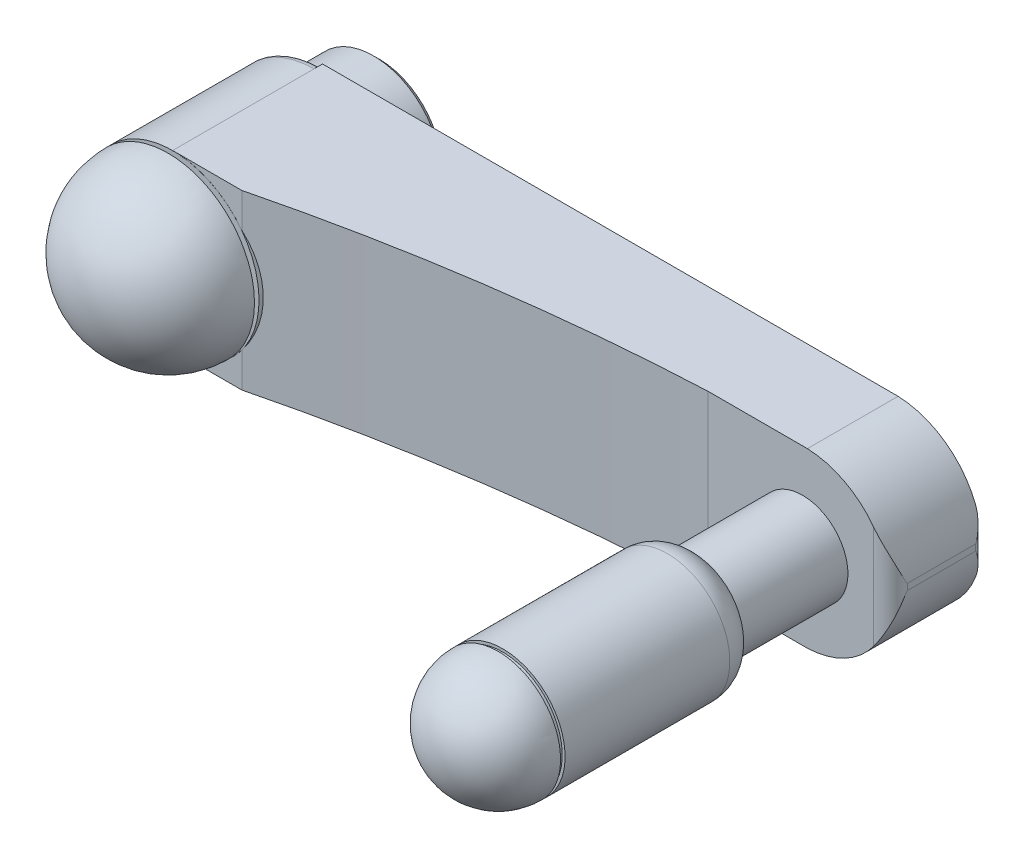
ISO-10303-21;
HEADER;
FILE_DESCRIPTION(('STEP AP214'),'2;1');
FILE_NAME('part.step','',(''),(''),'','','');
FILE_SCHEMA(('AUTOMOTIVE_DESIGN { 1 0 10303 214 1 1 1 1 }'));
ENDSEC;
DATA;
#1=APPLICATION_CONTEXT('core data for automotive mechanical design processes');
#2=APPLICATION_PROTOCOL_DEFINITION('international standard','automotive_design',2000,#1);
#3=PRODUCT_CONTEXT('',#1,'mechanical');
#4=PRODUCT('Part','Part','',(#3));
#5=PRODUCT_RELATED_PRODUCT_CATEGORY('part','',(#4));
#6=PRODUCT_DEFINITION_FORMATION('','',#4);
#7=PRODUCT_DEFINITION_CONTEXT('part definition',#1,'design');
#8=PRODUCT_DEFINITION('design','',#6,#7);
#9=PRODUCT_DEFINITION_SHAPE('','',#8);
#10=(LENGTH_UNIT() NAMED_UNIT(*) SI_UNIT(.MILLI.,.METRE.));
#11=(NAMED_UNIT(*) PLANE_ANGLE_UNIT() SI_UNIT($,.RADIAN.));
#12=(NAMED_UNIT(*) SI_UNIT($,.STERADIAN.) SOLID_ANGLE_UNIT());
#13=UNCERTAINTY_MEASURE_WITH_UNIT(LENGTH_MEASURE(1.E-05),#10,'distance_accuracy_value','');
#14=(GEOMETRIC_REPRESENTATION_CONTEXT(3) GLOBAL_UNCERTAINTY_ASSIGNED_CONTEXT((#13)) GLOBAL_UNIT_ASSIGNED_CONTEXT((#10,
#11,#12)) REPRESENTATION_CONTEXT('',''));
#15=CARTESIAN_POINT('',(0.,0.,0.));
#16=DIRECTION('',(0.,0.,1.));
#17=DIRECTION('',(1.,0.,0.));
#18=AXIS2_PLACEMENT_3D('',#15,#16,#17);
#19=CARTESIAN_POINT('',(0.,0.,37.25));
#20=DIRECTION('',(1.,0.,0.));
#21=DIRECTION('',(0.,-1.,0.));
#22=AXIS2_PLACEMENT_3D('',#19,#20,#21);
#23=SPHERICAL_SURFACE('',#22,11.75);
#24=CARTESIAN_POINT('',(0.,0.,37.25));
#25=DIRECTION('',(0.,0.,1.));
#26=DIRECTION('',(0.,-1.,0.));
#27=AXIS2_PLACEMENT_3D('',#24,#25,#26);
#28=CIRCLE('',#27,11.75);
#29=CARTESIAN_POINT('',(11.75,0.,37.25));
#30=VERTEX_POINT('',#29);
#31=CARTESIAN_POINT('',(-11.75,0.,37.25));
#32=VERTEX_POINT('',#31);
#33=EDGE_CURVE('E198',#30,#32,#28,.F.);
#34=ORIENTED_EDGE('',*,*,#33,.T.);
#35=CARTESIAN_POINT('',(0.,0.,37.25));
#36=DIRECTION('',(0.,0.,1.));
#37=DIRECTION('',(0.,-1.,0.));
#38=AXIS2_PLACEMENT_3D('',#35,#36,#37);
#39=CIRCLE('',#38,11.75);
#40=EDGE_CURVE('E32',#32,#30,#39,.F.);
#41=ORIENTED_EDGE('',*,*,#40,.T.);
#42=EDGE_LOOP('',(#34,#41));
#43=FACE_BOUND('',#42,.T.);
#44=ADVANCED_FACE('F14',(#43),#23,.F.);
#45=CARTESIAN_POINT('',(0.,0.,0.));
#46=DIRECTION('',(0.,0.,1.));
#47=DIRECTION('',(0.,-1.,0.));
#48=AXIS2_PLACEMENT_3D('',#45,#46,#47);
#49=CYLINDRICAL_SURFACE('',#48,11.75);
#50=ORIENTED_EDGE('',*,*,#40,.F.);
#51=ORIENTED_EDGE('',*,*,#33,.F.);
#52=EDGE_LOOP('',(#50,#51));
#53=FACE_BOUND('',#52,.T.);
#54=CARTESIAN_POINT('',(0.,0.,33.));
#55=DIRECTION('',(0.,0.,1.));
#56=DIRECTION('',(0.,-1.,0.));
#57=AXIS2_PLACEMENT_3D('',#54,#55,#56);
#58=CIRCLE('',#57,11.75);
#59=CARTESIAN_POINT('',(0.,-11.75,33.));
#60=VERTEX_POINT('',#59);
#61=EDGE_CURVE('E205',#60,#60,#58,.T.);
#62=ORIENTED_EDGE('',*,*,#61,.F.);
#63=EDGE_LOOP('',(#62));
#64=FACE_BOUND('',#63,.T.);
#65=ADVANCED_FACE('F252',(#53,#64),#49,.F.);
#66=CARTESIAN_POINT('',(11.75,0.,33.));
#67=DIRECTION('',(0.,0.,1.));
#68=DIRECTION('',(0.,-1.,0.));
#69=AXIS2_PLACEMENT_3D('',#66,#67,#68);
#70=PLANE('',#69);
#71=ORIENTED_EDGE('',*,*,#61,.T.);
#72=EDGE_LOOP('',(#71));
#73=FACE_BOUND('',#72,.T.);
#74=CARTESIAN_POINT('',(0.,0.,33.));
#75=DIRECTION('',(0.,0.,1.));
#76=DIRECTION('',(0.,-1.,0.));
#77=AXIS2_PLACEMENT_3D('',#74,#75,#76);
#78=CIRCLE('',#77,7.);
#79=CARTESIAN_POINT('',(0.,-7.,33.));
#80=VERTEX_POINT('',#79);
#81=EDGE_CURVE('E208',#80,#80,#78,.F.);
#82=ORIENTED_EDGE('',*,*,#81,.T.);
#83=EDGE_LOOP('',(#82));
#84=FACE_BOUND('',#83,.T.);
#85=ADVANCED_FACE('F239',(#73,#84),#70,.T.);
#86=CARTESIAN_POINT('',(0.,0.,33.));
#87=DIRECTION('',(0.,0.,1.));
#88=DIRECTION('',(0.,-1.,0.));
#89=AXIS2_PLACEMENT_3D('',#86,#87,#88);
#90=CONICAL_SURFACE('',#89,7.,0.785398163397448);
#91=ORIENTED_EDGE('',*,*,#81,.F.);
#92=EDGE_LOOP('',(#91));
#93=FACE_BOUND('',#92,.T.);
#94=CARTESIAN_POINT('',(0.,0.,32.));
#95=DIRECTION('',(0.,0.,1.));
#96=DIRECTION('',(0.,-1.,0.));
#97=AXIS2_PLACEMENT_3D('',#94,#95,#96);
#98=CIRCLE('',#97,6.);
#99=CARTESIAN_POINT('',(0.,-6.,32.));
#100=VERTEX_POINT('',#99);
#101=EDGE_CURVE('E223',#100,#100,#98,.F.);
#102=ORIENTED_EDGE('',*,*,#101,.T.);
#103=EDGE_LOOP('',(#102));
#104=FACE_BOUND('',#103,.T.);
#105=ADVANCED_FACE('F238',(#93,#104),#90,.F.);
#106=CARTESIAN_POINT('',(0.,0.,0.));
#107=DIRECTION('',(0.,0.,1.));
#108=DIRECTION('',(0.,-1.,0.));
#109=AXIS2_PLACEMENT_3D('',#106,#107,#108);
#110=CYLINDRICAL_SURFACE('',#109,6.);
#111=ORIENTED_EDGE('',*,*,#101,.F.);
#112=EDGE_LOOP('',(#111));
#113=FACE_BOUND('',#112,.T.);
#114=CARTESIAN_POINT('',(0.,0.,0.99999999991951));
#115=DIRECTION('',(0.,0.,-1.));
#116=DIRECTION('',(0.,1.,0.));
#117=AXIS2_PLACEMENT_3D('',#114,#115,#116);
#118=CIRCLE('',#117,5.99999999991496);
#119=CARTESIAN_POINT('',(0.,5.99999999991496,0.99999999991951));
#120=VERTEX_POINT('',#119);
#121=EDGE_CURVE('E468',#120,#120,#118,.T.);
#122=ORIENTED_EDGE('',*,*,#121,.T.);
#123=EDGE_LOOP('',(#122));
#124=FACE_BOUND('',#123,.T.);
#125=ADVANCED_FACE('F236',(#113,#124),#110,.F.);
#126=CARTESIAN_POINT('',(0.,0.,37.25));
#127=DIRECTION('',(1.,0.,0.));
#128=DIRECTION('',(0.,-1.,0.));
#129=AXIS2_PLACEMENT_3D('',#126,#127,#128);
#130=SPHERICAL_SURFACE('',#129,15.25);
#131=CARTESIAN_POINT('',(0.,0.,37.25));
#132=DIRECTION('',(0.,0.,-1.));
#133=DIRECTION('',(1.,0.,0.));
#134=AXIS2_PLACEMENT_3D('',#131,#132,#133);
#135=CIRCLE('',#134,15.25);
#136=CARTESIAN_POINT('',(-15.25,0.,37.25));
#137=VERTEX_POINT('',#136);
#138=CARTESIAN_POINT('',(15.25,0.,37.25));
#139=VERTEX_POINT('',#138);
#140=EDGE_CURVE('E211',#137,#139,#135,.F.);
#141=ORIENTED_EDGE('',*,*,#140,.T.);
#142=CARTESIAN_POINT('',(15.25,0.,37.25));
#143=CARTESIAN_POINT('',(15.25,3.33333333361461E-05,37.25));
#144=CARTESIAN_POINT('',(15.2499999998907,6.66666666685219E-05,37.25));
#145=CARTESIAN_POINT('',(15.249999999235,0.000166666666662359,37.25));
#146=CARTESIAN_POINT('',(15.2499999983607,0.000233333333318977,37.25));
#147=CARTESIAN_POINT('',(15.2499999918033,0.000566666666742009,37.25));
#148=CARTESIAN_POINT('',(15.2499999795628,0.000833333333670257,37.25));
#149=CARTESIAN_POINT('',(15.2499998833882,0.00216666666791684,37.25));
#150=CARTESIAN_POINT('',(15.2499996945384,0.00323333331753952,37.25));
#151=CARTESIAN_POINT('',(15.2499981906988,0.00856666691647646,37.25));
#152=CARTESIAN_POINT('',(15.2499951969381,0.0128333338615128,37.25));
#153=CARTESIAN_POINT('',(15.2499712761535,0.0341666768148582,37.25));
#154=CARTESIAN_POINT('',(15.2499234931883,0.051233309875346,37.25));
#155=CARTESIAN_POINT('',(15.2495412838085,0.136567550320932,37.25));
#156=CARTESIAN_POINT('',(15.2487769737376,0.204834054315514,37.25));
#157=CARTESIAN_POINT('',(15.2426633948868,0.546214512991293,37.25));
#158=CARTESIAN_POINT('',(15.2304380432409,0.819194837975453,37.25));
#159=CARTESIAN_POINT('',(15.1321619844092,2.18807762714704,37.25));
#160=CARTESIAN_POINT('',(14.9346588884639,3.2777698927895,37.25));
#161=CARTESIAN_POINT('',(14.1336954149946,5.97653531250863,37.25));
#162=CARTESIAN_POINT('',(13.3660442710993,7.53924189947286,37.25));
#163=CARTESIAN_POINT('',(11.3579326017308,10.3206284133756,37.25));
#164=CARTESIAN_POINT('',(10.1174720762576,11.5393083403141,37.25));
#165=CARTESIAN_POINT('',(7.30106744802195,13.4975540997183,37.25));
#166=CARTESIAN_POINT('',(5.72512334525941,14.237119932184,37.25));
#167=CARTESIAN_POINT('',(2.74917845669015,15.0637416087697,37.25));
#168=CARTESIAN_POINT('',(1.37564099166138,15.2506103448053,37.25));
#169=CARTESIAN_POINT('',(-1.71295121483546,15.2492399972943,37.25));
#170=CARTESIAN_POINT('',(-3.42916400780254,14.9577883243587,37.25));
#171=CARTESIAN_POINT('',(-6.66650651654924,13.8228898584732,37.25));
#172=CARTESIAN_POINT('',(-8.18763623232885,12.9794430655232,37.25));
#173=CARTESIAN_POINT('',(-10.8654945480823,10.8371101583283,37.25));
#174=CARTESIAN_POINT('',(-12.0222231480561,9.53822404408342,37.25));
#175=CARTESIAN_POINT('',(-13.8402719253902,6.62906851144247,37.25));
#176=CARTESIAN_POINT('',(-14.5015921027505,5.01879909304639,37.25));
#177=CARTESIAN_POINT('',(-15.1256410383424,2.24840247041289,37.25));
#178=CARTESIAN_POINT('',(-15.2499926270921,1.1228163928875,37.25));
#179=CARTESIAN_POINT('',(-15.249999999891,6.6666664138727E-05,37.25));
#180=CARTESIAN_POINT('',(-15.2500000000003,3.33333308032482E-05,37.25));
#181=CARTESIAN_POINT('',(-15.25,0.,37.25));
#182=B_SPLINE_CURVE_WITH_KNOTS('',3,(#142,#143,#144,#145,#146,#147,#148,#149,#150,#151,#152,
#153,#154,#155,#156,#157,#158,#159,#160,#161,#162,#163,#164,#165,#166,#167,#168,#169,#170,#171,
#172,#173,#174,#175,#176,#177,#178,#179,#180,#181),.UNSPECIFIED.,.F.,.F.,(4,2,2,2,2,2,2,2,2,2,2,
2,2,2,2,2,2,2,2,4),(0.,9.99999999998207E-05,0.000300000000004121,0.00110000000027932,
0.00430000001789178,0.0171000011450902,0.0683000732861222,0.273104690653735,1.09260055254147,
4.38870452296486,9.50921794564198,14.6297313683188,19.7502447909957,23.8624390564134,
28.9829524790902,34.1034659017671,39.2239793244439,44.3444927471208,47.7126416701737,
47.7127416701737),.UNSPECIFIED.);
#183=EDGE_CURVE('E214',#139,#137,#182,.T.);
#184=ORIENTED_EDGE('',*,*,#183,.T.);
#185=EDGE_LOOP('',(#141,#184));
#186=FACE_BOUND('',#185,.T.);
#187=ADVANCED_FACE('F230',(#186),#130,.T.);
#188=CARTESIAN_POINT('',(0.,0.,0.));
#189=DIRECTION('',(0.,0.,-1.));
#190=DIRECTION('',(0.,1.,0.));
#191=AXIS2_PLACEMENT_3D('',#188,#189,#190);
#192=CONICAL_SURFACE('',#191,6.99999999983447,0.785398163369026);
#193=ORIENTED_EDGE('',*,*,#121,.F.);
#194=EDGE_LOOP('',(#193));
#195=FACE_BOUND('',#194,.T.);
#196=CARTESIAN_POINT('',(0.,0.,-5.6843418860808E-11));
#197=DIRECTION('',(0.,0.,-1.));
#198=DIRECTION('',(0.,1.,0.));
#199=AXIS2_PLACEMENT_3D('',#196,#197,#198);
#200=CIRCLE('',#199,6.99999999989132);
#201=CARTESIAN_POINT('',(0.,6.99999999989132,-5.6843418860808E-11));
#202=VERTEX_POINT('',#201);
#203=EDGE_CURVE('E420',#202,#202,#200,.T.);
#204=ORIENTED_EDGE('',*,*,#203,.T.);
#205=EDGE_LOOP('',(#204));
#206=FACE_BOUND('',#205,.T.);
#207=ADVANCED_FACE('F235',(#195,#206),#192,.F.);
#208=CARTESIAN_POINT('',(15.25,0.,37.25));
#209=DIRECTION('',(0.,0.,1.));
#210=DIRECTION('',(0.,-1.,0.));
#211=AXIS2_PLACEMENT_3D('',#208,#209,#210);
#212=PLANE('',#211);
#213=ORIENTED_EDGE('',*,*,#183,.F.);
#214=ORIENTED_EDGE('',*,*,#140,.F.);
#215=EDGE_LOOP('',(#213,#214));
#216=FACE_BOUND('',#215,.T.);
#217=CARTESIAN_POINT('',(0.,0.,37.25));
#218=DIRECTION('',(0.,0.,1.));
#219=DIRECTION('',(0.,-1.,0.));
#220=AXIS2_PLACEMENT_3D('',#217,#218,#219);
#221=CIRCLE('',#220,13.75);
#222=CARTESIAN_POINT('',(0.,-13.75,37.25));
#223=VERTEX_POINT('',#222);
#224=EDGE_CURVE('E224',#223,#223,#221,.F.);
#225=ORIENTED_EDGE('',*,*,#224,.F.);
#226=EDGE_LOOP('',(#225));
#227=FACE_BOUND('',#226,.T.);
#228=ADVANCED_FACE('F226',(#216,#227),#212,.F.);
#229=CARTESIAN_POINT('',(11.,0.,0.));
#230=DIRECTION('',(0.,0.,1.));
#231=DIRECTION('',(0.,-1.,0.));
#232=AXIS2_PLACEMENT_3D('',#229,#230,#231);
#233=PLANE('',#232);
#234=CARTESIAN_POINT('',(0.,0.,0.));
#235=DIRECTION('',(0.,0.,1.));
#236=DIRECTION('',(-1.,0.,0.));
#237=AXIS2_PLACEMENT_3D('',#234,#235,#236);
#238=CIRCLE('',#237,11.);
#239=CARTESIAN_POINT('',(-11.,0.,0.));
#240=VERTEX_POINT('',#239);
#241=EDGE_CURVE('E433',#240,#240,#238,.T.);
#242=ORIENTED_EDGE('',*,*,#241,.F.);
#243=EDGE_LOOP('',(#242));
#244=FACE_BOUND('',#243,.T.);
#245=ORIENTED_EDGE('',*,*,#203,.F.);
#246=EDGE_LOOP('',(#245));
#247=FACE_BOUND('',#246,.T.);
#248=ADVANCED_FACE('F483',(#244,#247),#233,.F.);
#249=CARTESIAN_POINT('',(0.,0.,0.));
#250=DIRECTION('',(0.,0.,1.));
#251=DIRECTION('',(0.,-1.,0.));
#252=AXIS2_PLACEMENT_3D('',#249,#250,#251);
#253=CYLINDRICAL_SURFACE('',#252,13.75);
#254=ORIENTED_EDGE('',*,*,#224,.T.);
#255=EDGE_LOOP('',(#254));
#256=FACE_BOUND('',#255,.T.);
#257=CARTESIAN_POINT('',(0.,0.,36.45));
#258=DIRECTION('',(0.,0.,1.));
#259=DIRECTION('',(0.,-1.,0.));
#260=AXIS2_PLACEMENT_3D('',#257,#258,#259);
#261=CIRCLE('',#260,13.75);
#262=CARTESIAN_POINT('',(0.,-13.75,36.45));
#263=VERTEX_POINT('',#262);
#264=EDGE_CURVE('E471',#263,#263,#261,.T.);
#265=ORIENTED_EDGE('',*,*,#264,.T.);
#266=EDGE_LOOP('',(#265));
#267=FACE_BOUND('',#266,.T.);
#268=ADVANCED_FACE('F479',(#256,#267),#253,.T.);
#269=CARTESIAN_POINT('',(0.,0.,1.));
#270=DIRECTION('',(0.,0.,1.));
#271=DIRECTION('',(-1.,0.,0.));
#272=AXIS2_PLACEMENT_3D('',#269,#270,#271);
#273=CONICAL_SURFACE('',#272,12.,0.785398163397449);
#274=CARTESIAN_POINT('',(0.,0.,1.));
#275=DIRECTION('',(0.,0.,1.));
#276=DIRECTION('',(0.,-1.,0.));
#277=AXIS2_PLACEMENT_3D('',#274,#275,#276);
#278=CIRCLE('',#277,12.);
#279=CARTESIAN_POINT('',(0.,-12.,1.));
#280=VERTEX_POINT('',#279);
#281=EDGE_CURVE('E571',#280,#280,#278,.T.);
#282=ORIENTED_EDGE('',*,*,#281,.F.);
#283=EDGE_LOOP('',(#282));
#284=FACE_BOUND('',#283,.T.);
#285=ORIENTED_EDGE('',*,*,#241,.T.);
#286=EDGE_LOOP('',(#285));
#287=FACE_BOUND('',#286,.T.);
#288=ADVANCED_FACE('F610',(#284,#287),#273,.T.);
#289=CARTESIAN_POINT('',(13.75,0.,36.45));
#290=DIRECTION('',(0.,0.,-1.));
#291=DIRECTION('',(0.,1.,0.));
#292=AXIS2_PLACEMENT_3D('',#289,#290,#291);
#293=PLANE('',#292);
#294=ORIENTED_EDGE('',*,*,#264,.F.);
#295=EDGE_LOOP('',(#294));
#296=FACE_BOUND('',#295,.T.);
#297=CARTESIAN_POINT('',(0.,0.,36.45));
#298=DIRECTION('',(0.,0.,1.));
#299=DIRECTION('',(0.,-1.,0.));
#300=AXIS2_PLACEMENT_3D('',#297,#298,#299);
#301=CIRCLE('',#300,15.25);
#302=CARTESIAN_POINT('',(0.,-15.25,36.45));
#303=VERTEX_POINT('',#302);
#304=EDGE_CURVE('E439',#303,#303,#301,.F.);
#305=ORIENTED_EDGE('',*,*,#304,.F.);
#306=EDGE_LOOP('',(#305));
#307=FACE_BOUND('',#306,.T.);
#308=ADVANCED_FACE('F586',(#296,#307),#293,.F.);
#309=CARTESIAN_POINT('',(0.,0.,11.5));
#310=DIRECTION('',(0.,0.,-1.));
#311=DIRECTION('',(0.,1.,0.));
#312=AXIS2_PLACEMENT_3D('',#309,#310,#311);
#313=TOROIDAL_SURFACE('',#312,13.75,1.5);
#314=CARTESIAN_POINT('',(0.,15.25,11.5));
#315=CARTESIAN_POINT('',(0.,15.2499997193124,11.4577978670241));
#316=CARTESIAN_POINT('',(0.,15.2482178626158,11.4156159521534));
#317=CARTESIAN_POINT('',(0.,15.2411093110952,11.3315539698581));
#318=CARTESIAN_POINT('',(0.,15.2357827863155,11.2896738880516));
#319=CARTESIAN_POINT('',(0.,15.2145368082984,11.1650096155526));
#320=CARTESIAN_POINT('',(0.,15.1933508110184,11.0830604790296));
#321=CARTESIAN_POINT('',(0.,15.1375221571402,10.9238845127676));
#322=CARTESIAN_POINT('',(0.,15.1028730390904,10.8466599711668));
#323=CARTESIAN_POINT('',(0.,15.0211053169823,10.6991262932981));
#324=CARTESIAN_POINT('',(0.,14.9739889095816,10.628815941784));
#325=CARTESIAN_POINT('',(0.,14.8686233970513,10.4971062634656));
#326=CARTESIAN_POINT('',(0.,14.810374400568,10.435706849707));
#327=CARTESIAN_POINT('',(0.,14.6843812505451,10.3235455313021));
#328=CARTESIAN_POINT('',(0.,14.6166352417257,10.2727857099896));
#329=CARTESIAN_POINT('',(0.,14.473576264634,10.183353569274));
#330=CARTESIAN_POINT('',(0.,14.3982618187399,10.1446836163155));
#331=CARTESIAN_POINT('',(0.,14.242224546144,10.0805567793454));
#332=CARTESIAN_POINT('',(0.,14.1615049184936,10.0550921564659));
#333=CARTESIAN_POINT('',(0.,14.0252427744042,10.024427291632));
#334=CARTESIAN_POINT('',(0.,13.9705574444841,10.015272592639));
#335=CARTESIAN_POINT('',(0.,13.8605890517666,10.0030597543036));
#336=CARTESIAN_POINT('',(0.,13.8053069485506,9.99999297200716));
#337=CARTESIAN_POINT('',(0.,13.75,10.));
#338=B_SPLINE_CURVE_WITH_KNOTS('',3,(#314,#315,#316,#317,#318,#319,#320,#321,#322,#323,#324,
#325,#326,#327,#328,#329,#330,#331,#332,#333,#334,#335,#336,#337),.UNSPECIFIED.,.F.,.F.,(4,2,2,
2,2,2,2,2,2,2,2,4),(0.,0.126528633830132,0.253051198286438,0.505678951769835,0.758428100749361,
1.01113274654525,1.26383492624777,1.5165865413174,1.76938759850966,2.02204033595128,
2.18806371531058,2.35385122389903),.UNSPECIFIED.);
#339=CARTESIAN_POINT('',(0.,15.25,11.5));
#340=VERTEX_POINT('',#339);
#341=CARTESIAN_POINT('',(0.,13.75,10.));
#342=VERTEX_POINT('',#341);
#343=EDGE_CURVE('E445',#340,#342,#338,.T.);
#344=ORIENTED_EDGE('',*,*,#343,.T.);
#345=CARTESIAN_POINT('',(0.,0.,10.));
#346=DIRECTION('',(0.,0.,1.));
#347=DIRECTION('',(0.,1.,0.));
#348=AXIS2_PLACEMENT_3D('',#345,#346,#347);
#349=CIRCLE('',#348,13.75);
#350=CARTESIAN_POINT('',(0.,-13.75,10.));
#351=VERTEX_POINT('',#350);
#352=EDGE_CURVE('E548',#342,#351,#349,.T.);
#353=ORIENTED_EDGE('',*,*,#352,.T.);
#354=CARTESIAN_POINT('',(0.,-13.75,10.));
#355=CARTESIAN_POINT('',(0.,-13.7922021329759,10.0000002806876));
#356=CARTESIAN_POINT('',(0.,-13.8343840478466,10.0017821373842));
#357=CARTESIAN_POINT('',(0.,-13.9184460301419,10.0088906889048));
#358=CARTESIAN_POINT('',(0.,-13.9603261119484,10.0142172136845));
#359=CARTESIAN_POINT('',(0.,-14.0849903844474,10.0354631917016));
#360=CARTESIAN_POINT('',(0.,-14.1669395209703,10.0566491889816));
#361=CARTESIAN_POINT('',(0.,-14.3261154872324,10.1124778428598));
#362=CARTESIAN_POINT('',(0.,-14.4033400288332,10.1471269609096));
#363=CARTESIAN_POINT('',(0.,-14.5508737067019,10.2288946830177));
#364=CARTESIAN_POINT('',(0.,-14.6211840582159,10.2760110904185));
#365=CARTESIAN_POINT('',(0.,-14.7528937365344,10.3813766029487));
#366=CARTESIAN_POINT('',(0.,-14.814293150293,10.439625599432));
#367=CARTESIAN_POINT('',(0.,-14.9264544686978,10.5656187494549));
#368=CARTESIAN_POINT('',(0.,-14.9772142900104,10.6333647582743));
#369=CARTESIAN_POINT('',(0.,-15.066646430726,10.776423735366));
#370=CARTESIAN_POINT('',(0.,-15.1053163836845,10.8517381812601));
#371=CARTESIAN_POINT('',(0.,-15.1694432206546,11.007775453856));
#372=CARTESIAN_POINT('',(0.,-15.1949078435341,11.0884950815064));
#373=CARTESIAN_POINT('',(0.,-15.225572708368,11.2247572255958));
#374=CARTESIAN_POINT('',(0.,-15.234727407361,11.2794425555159));
#375=CARTESIAN_POINT('',(0.,-15.2469402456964,11.3894109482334));
#376=CARTESIAN_POINT('',(0.,-15.2500070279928,11.4446930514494));
#377=CARTESIAN_POINT('',(0.,-15.25,11.5));
#378=B_SPLINE_CURVE_WITH_KNOTS('',3,(#354,#355,#356,#357,#358,#359,#360,#361,#362,#363,#364,
#365,#366,#367,#368,#369,#370,#371,#372,#373,#374,#375,#376,#377),.UNSPECIFIED.,.F.,.F.,(4,2,2,
2,2,2,2,2,2,2,2,4),(0.,0.126528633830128,0.253051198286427,0.505678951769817,0.758428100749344,
1.01113274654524,1.26383492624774,1.51658654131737,1.76938759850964,2.02204033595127,
2.18806371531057,2.35385122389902),.UNSPECIFIED.);
#379=CARTESIAN_POINT('',(0.,-15.25,11.5));
#380=VERTEX_POINT('',#379);
#381=EDGE_CURVE('E446',#351,#380,#378,.T.);
#382=ORIENTED_EDGE('',*,*,#381,.T.);
#383=CARTESIAN_POINT('',(0.,0.,11.5));
#384=DIRECTION('',(0.,0.,-1.));
#385=DIRECTION('',(0.,1.,0.));
#386=AXIS2_PLACEMENT_3D('',#383,#384,#385);
#387=CIRCLE('',#386,15.25);
#388=EDGE_CURVE('E442',#380,#340,#387,.T.);
#389=ORIENTED_EDGE('',*,*,#388,.T.);
#390=EDGE_LOOP('',(#344,#353,#382,#389));
#391=FACE_BOUND('',#390,.T.);
#392=ADVANCED_FACE('F581',(#391),#313,.T.);
#393=CARTESIAN_POINT('',(0.,0.,0.));
#394=DIRECTION('',(0.,0.,1.));
#395=DIRECTION('',(0.,-1.,0.));
#396=AXIS2_PLACEMENT_3D('',#393,#394,#395);
#397=CYLINDRICAL_SURFACE('',#396,12.);
#398=CARTESIAN_POINT('',(0.,0.,10.));
#399=DIRECTION('',(0.,0.,1.));
#400=DIRECTION('',(0.,-1.,0.));
#401=AXIS2_PLACEMENT_3D('',#398,#399,#400);
#402=CIRCLE('',#401,12.);
#403=CARTESIAN_POINT('',(0.,-12.,10.));
#404=VERTEX_POINT('',#403);
#405=EDGE_CURVE('E557',#404,#404,#402,.F.);
#406=ORIENTED_EDGE('',*,*,#405,.T.);
#407=EDGE_LOOP('',(#406));
#408=FACE_BOUND('',#407,.T.);
#409=ORIENTED_EDGE('',*,*,#281,.T.);
#410=EDGE_LOOP('',(#409));
#411=FACE_BOUND('',#410,.T.);
#412=ADVANCED_FACE('F585',(#408,#411),#397,.T.);
#413=CARTESIAN_POINT('',(0.,-15.25,36.44));
#414=DIRECTION('',(1.,0.,0.));
#415=DIRECTION('',(0.,1.,0.));
#416=AXIS2_PLACEMENT_3D('',#413,#414,#415);
#417=PLANE('',#416);
#418=ORIENTED_EDGE('',*,*,#381,.F.);
#419=DIRECTION('',(0.,1.,0.));
#420=VECTOR('',#419,1.);
#421=CARTESIAN_POINT('',(0.,-15.25,10.));
#422=LINE('',#421,#420);
#423=CARTESIAN_POINT('',(0.,-15.25,10.));
#424=VERTEX_POINT('',#423);
#425=EDGE_CURVE('E447',#424,#351,#422,.T.);
#426=ORIENTED_EDGE('',*,*,#425,.F.);
#427=DIRECTION('',(0.,0.,1.));
#428=VECTOR('',#427,1.);
#429=CARTESIAN_POINT('',(0.,-15.25,11.));
#430=LINE('',#429,#428);
#431=EDGE_CURVE('E402',#380,#424,#430,.F.);
#432=ORIENTED_EDGE('',*,*,#431,.F.);
#433=EDGE_LOOP('',(#418,#426,#432));
#434=FACE_BOUND('',#433,.T.);
#435=ADVANCED_FACE('F617',(#434),#417,.F.);
#436=CARTESIAN_POINT('',(12.2,-15.25,36.44));
#437=DIRECTION('',(0.,0.,-1.));
#438=DIRECTION('',(0.,1.,0.));
#439=AXIS2_PLACEMENT_3D('',#436,#437,#438);
#440=PLANE('',#439);
#441=DIRECTION('',(1.,0.,0.));
#442=VECTOR('',#441,1.);
#443=CARTESIAN_POINT('',(115.25,-15.25,36.44));
#444=LINE('',#443,#442);
#445=CARTESIAN_POINT('',(12.1999999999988,-15.25,36.44));
#446=VERTEX_POINT('',#445);
#447=CARTESIAN_POINT('',(0.,-15.25,36.44));
#448=VERTEX_POINT('',#447);
#449=EDGE_CURVE('E428',#446,#448,#444,.F.);
#450=ORIENTED_EDGE('',*,*,#449,.F.);
#451=DIRECTION('',(0.,-1.,0.));
#452=VECTOR('',#451,1.);
#453=CARTESIAN_POINT('',(12.1999999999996,-15.25,36.44));
#454=LINE('',#453,#452);
#455=CARTESIAN_POINT('',(12.1999999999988,-9.15000000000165,36.44));
#456=VERTEX_POINT('',#455);
#457=EDGE_CURVE('E419',#446,#456,#454,.F.);
#458=ORIENTED_EDGE('',*,*,#457,.T.);
#459=CARTESIAN_POINT('',(0.,0.,36.44));
#460=DIRECTION('',(0.,0.,1.));
#461=DIRECTION('',(0.,-1.,0.));
#462=AXIS2_PLACEMENT_3D('',#459,#460,#461);
#463=CIRCLE('',#462,15.25);
#464=EDGE_CURVE('E450',#448,#456,#463,.T.);
#465=ORIENTED_EDGE('',*,*,#464,.F.);
#466=EDGE_LOOP('',(#450,#458,#465));
#467=FACE_BOUND('',#466,.T.);
#468=ADVANCED_FACE('F340',(#467),#440,.F.);
#469=CARTESIAN_POINT('',(12.2,-15.25,36.44));
#470=DIRECTION('',(0.,0.,-1.));
#471=DIRECTION('',(0.,1.,0.));
#472=AXIS2_PLACEMENT_3D('',#469,#470,#471);
#473=PLANE('',#472);
#474=DIRECTION('',(0.,1.,0.));
#475=VECTOR('',#474,1.);
#476=CARTESIAN_POINT('',(12.2,-15.25,36.44));
#477=LINE('',#476,#475);
#478=CARTESIAN_POINT('',(12.1999999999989,15.25,36.44));
#479=VERTEX_POINT('',#478);
#480=CARTESIAN_POINT('',(12.1999999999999,9.15000000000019,36.44));
#481=VERTEX_POINT('',#480);
#482=EDGE_CURVE('E457',#479,#481,#477,.F.);
#483=ORIENTED_EDGE('',*,*,#482,.F.);
#484=DIRECTION('',(1.,0.,0.));
#485=VECTOR('',#484,1.);
#486=CARTESIAN_POINT('',(115.25,15.25,36.44));
#487=LINE('',#486,#485);
#488=CARTESIAN_POINT('',(0.,15.25,36.44));
#489=VERTEX_POINT('',#488);
#490=EDGE_CURVE('E461',#479,#489,#487,.F.);
#491=ORIENTED_EDGE('',*,*,#490,.T.);
#492=CARTESIAN_POINT('',(0.,0.,36.44));
#493=DIRECTION('',(0.,0.,1.));
#494=DIRECTION('',(0.,-1.,0.));
#495=AXIS2_PLACEMENT_3D('',#492,#493,#494);
#496=CIRCLE('',#495,15.25);
#497=EDGE_CURVE('E627',#481,#489,#496,.T.);
#498=ORIENTED_EDGE('',*,*,#497,.F.);
#499=EDGE_LOOP('',(#483,#491,#498));
#500=FACE_BOUND('',#499,.T.);
#501=ADVANCED_FACE('F615',(#500),#473,.F.);
#502=CARTESIAN_POINT('',(0.,0.,0.));
#503=DIRECTION('',(0.,0.,1.));
#504=DIRECTION('',(0.,-1.,0.));
#505=AXIS2_PLACEMENT_3D('',#502,#503,#504);
#506=CYLINDRICAL_SURFACE('',#505,15.25);
#507=ORIENTED_EDGE('',*,*,#304,.T.);
#508=EDGE_LOOP('',(#507));
#509=FACE_BOUND('',#508,.T.);
#510=ORIENTED_EDGE('',*,*,#388,.F.);
#511=DIRECTION('',(0.,0.,1.));
#512=VECTOR('',#511,1.);
#513=CARTESIAN_POINT('',(0.,-15.25,11.));
#514=LINE('',#513,#512);
#515=EDGE_CURVE('E431',#448,#380,#514,.F.);
#516=ORIENTED_EDGE('',*,*,#515,.F.);
#517=ORIENTED_EDGE('',*,*,#464,.T.);
#518=CARTESIAN_POINT('',(12.1999999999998,-9.15000000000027,36.4399999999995));
#519=CARTESIAN_POINT('',(12.3251445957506,-8.98314048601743,36.408804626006));
#520=CARTESIAN_POINT('',(12.4469322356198,-8.81362414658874,36.3785166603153));
#521=CARTESIAN_POINT('',(12.6835885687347,-8.46951573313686,36.3197842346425));
#522=CARTESIAN_POINT('',(12.7984571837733,-8.29492360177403,36.2913397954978));
#523=CARTESIAN_POINT('',(13.1323347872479,-7.7639566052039,36.2088252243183));
#524=CARTESIAN_POINT('',(13.3406584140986,-7.4003339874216,36.157563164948));
#525=CARTESIAN_POINT('',(13.7270073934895,-6.65638923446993,36.0628050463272));
#526=CARTESIAN_POINT('',(13.9050308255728,-6.27606604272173,36.0193094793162));
#527=CARTESIAN_POINT('',(14.229345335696,-5.50132237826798,35.9402853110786));
#528=CARTESIAN_POINT('',(14.3756377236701,-5.10690248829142,35.9047563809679));
#529=CARTESIAN_POINT('',(14.6354021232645,-4.30636300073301,35.8418020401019));
#530=CARTESIAN_POINT('',(14.7488435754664,-3.90023289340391,35.8143841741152));
#531=CARTESIAN_POINT('',(14.9417781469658,-3.07952224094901,35.7678225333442));
#532=CARTESIAN_POINT('',(15.0212715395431,-2.66494176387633,35.7486786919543));
#533=CARTESIAN_POINT('',(15.1456031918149,-1.83057478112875,35.7187618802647));
#534=CARTESIAN_POINT('',(15.1904624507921,-1.41079158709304,35.7079838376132));
#535=CARTESIAN_POINT('',(15.245225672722,-0.568826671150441,35.6948286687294));
#536=CARTESIAN_POINT('',(15.2551303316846,-0.146644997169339,35.6924513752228));
#537=CARTESIAN_POINT('',(15.2399786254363,0.692856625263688,35.6960897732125));
#538=CARTESIAN_POINT('',(15.2152683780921,1.11018322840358,35.7020223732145));
#539=CARTESIAN_POINT('',(15.1317081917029,1.94121203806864,35.7221061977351));
#540=CARTESIAN_POINT('',(15.0728577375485,2.35491418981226,35.7362575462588));
#541=CARTESIAN_POINT('',(14.9214696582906,3.17593783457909,35.7727237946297));
#542=CARTESIAN_POINT('',(14.8289163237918,3.58325625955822,35.7950425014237));
#543=CARTESIAN_POINT('',(14.6108907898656,4.38842845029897,35.8477412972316));
#544=CARTESIAN_POINT('',(14.485420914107,4.7862828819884,35.8781208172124));
#545=CARTESIAN_POINT('',(14.2153140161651,5.53453158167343,35.9437123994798));
#546=CARTESIAN_POINT('',(14.0734138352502,5.88597724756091,35.9782445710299));
#547=CARTESIAN_POINT('',(13.7641558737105,6.57675570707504,36.0537376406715));
#548=CARTESIAN_POINT('',(13.5967992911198,6.91608906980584,36.0946982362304));
#549=CARTESIAN_POINT('',(13.2378661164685,7.58048751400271,36.1828576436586));
#550=CARTESIAN_POINT('',(13.0463089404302,7.90556375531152,36.2300514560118));
#551=CARTESIAN_POINT('',(12.6401330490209,8.5400039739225,36.3305155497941));
#552=CARTESIAN_POINT('',(12.4255136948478,8.84936751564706,36.3837859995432));
#553=CARTESIAN_POINT('',(12.1999999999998,9.15000000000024,36.4399999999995));
#554=B_SPLINE_CURVE_WITH_KNOTS('',3,(#518,#519,#520,#521,#522,#523,#524,#525,#526,#527,#528,
#529,#530,#531,#532,#533,#534,#535,#536,#537,#538,#539,#540,#541,#542,#543,#544,#545,#546,#547,
#548,#549,#550,#551,#552,#553),.UNSPECIFIED.,.F.,.F.,(4,2,2,2,2,2,2,2,2,2,2,2,2,2,2,2,2,4),(0.,
0.632588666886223,1.26518448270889,2.53016007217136,3.79521580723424,5.06021930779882,
6.32639581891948,7.59256213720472,8.85796015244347,10.1233329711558,11.3761431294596,
12.6289721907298,13.882385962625,15.1357112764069,16.2763726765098,17.4169804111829,
18.5566787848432,19.6964087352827),.UNSPECIFIED.);
#555=EDGE_CURVE('E620',#456,#481,#554,.T.);
#556=ORIENTED_EDGE('',*,*,#555,.T.);
#557=ORIENTED_EDGE('',*,*,#497,.T.);
#558=DIRECTION('',(0.,0.,1.));
#559=VECTOR('',#558,1.);
#560=CARTESIAN_POINT('',(0.,15.25,11.));
#561=LINE('',#560,#559);
#562=EDGE_CURVE('E458',#489,#340,#561,.F.);
#563=ORIENTED_EDGE('',*,*,#562,.T.);
#564=EDGE_LOOP('',(#510,#516,#517,#556,#557,#563));
#565=FACE_BOUND('',#564,.T.);
#566=ADVANCED_FACE('F609',(#509,#565),#506,.T.);
#567=CARTESIAN_POINT('',(0.,-15.25,36.44));
#568=DIRECTION('',(1.,0.,0.));
#569=DIRECTION('',(0.,1.,0.));
#570=AXIS2_PLACEMENT_3D('',#567,#568,#569);
#571=PLANE('',#570);
#572=ORIENTED_EDGE('',*,*,#343,.F.);
#573=DIRECTION('',(0.,0.,1.));
#574=VECTOR('',#573,1.);
#575=CARTESIAN_POINT('',(0.,15.25,11.));
#576=LINE('',#575,#574);
#577=CARTESIAN_POINT('',(0.,15.25,10.));
#578=VERTEX_POINT('',#577);
#579=EDGE_CURVE('E425',#340,#578,#576,.F.);
#580=ORIENTED_EDGE('',*,*,#579,.T.);
#581=DIRECTION('',(0.,1.,0.));
#582=VECTOR('',#581,1.);
#583=CARTESIAN_POINT('',(0.,-15.25,10.));
#584=LINE('',#583,#582);
#585=EDGE_CURVE('E436',#342,#578,#584,.T.);
#586=ORIENTED_EDGE('',*,*,#585,.F.);
#587=EDGE_LOOP('',(#572,#580,#586));
#588=FACE_BOUND('',#587,.T.);
#589=ADVANCED_FACE('F380',(#588),#571,.F.);
#590=CARTESIAN_POINT('',(116.25,-15.25,11.));
#591=DIRECTION('',(-1.,0.,0.));
#592=DIRECTION('',(0.,-1.,0.));
#593=AXIS2_PLACEMENT_3D('',#590,#591,#592);
#594=PLANE('',#593);
#595=DIRECTION('',(0.,0.,1.));
#596=VECTOR('',#595,1.);
#597=CARTESIAN_POINT('',(116.25,0.552358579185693,101.));
#598=LINE('',#597,#596);
#599=CARTESIAN_POINT('',(116.25,0.552358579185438,23.));
#600=VERTEX_POINT('',#599);
#601=CARTESIAN_POINT('',(116.25,0.552358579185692,11.));
#602=VERTEX_POINT('',#601);
#603=EDGE_CURVE('E352',#600,#602,#598,.F.);
#604=ORIENTED_EDGE('',*,*,#603,.F.);
#605=DIRECTION('',(0.,-1.,0.));
#606=VECTOR('',#605,1.);
#607=CARTESIAN_POINT('',(116.25,-15.25,23.));
#608=LINE('',#607,#606);
#609=CARTESIAN_POINT('',(116.25,-0.552358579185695,23.));
#610=VERTEX_POINT('',#609);
#611=EDGE_CURVE('E400',#610,#600,#608,.F.);
#612=ORIENTED_EDGE('',*,*,#611,.F.);
#613=DIRECTION('',(0.,0.,1.));
#614=VECTOR('',#613,1.);
#615=CARTESIAN_POINT('',(116.25,-0.552358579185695,101.));
#616=LINE('',#615,#614);
#617=CARTESIAN_POINT('',(116.25,-0.552358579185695,11.));
#618=VERTEX_POINT('',#617);
#619=EDGE_CURVE('E310',#618,#610,#616,.T.);
#620=ORIENTED_EDGE('',*,*,#619,.F.);
#621=DIRECTION('',(0.,-1.,0.));
#622=VECTOR('',#621,1.);
#623=CARTESIAN_POINT('',(116.25,-15.25,11.));
#624=LINE('',#623,#622);
#625=EDGE_CURVE('E308',#602,#618,#624,.T.);
#626=ORIENTED_EDGE('',*,*,#625,.F.);
#627=EDGE_LOOP('',(#604,#612,#620,#626));
#628=FACE_BOUND('',#627,.T.);
#629=ADVANCED_FACE('F338',(#628),#594,.F.);
#630=CARTESIAN_POINT('',(115.25,-15.25,11.));
#631=DIRECTION('',(0.,-1.,0.));
#632=DIRECTION('',(1.,0.,0.));
#633=AXIS2_PLACEMENT_3D('',#630,#631,#632);
#634=CYLINDRICAL_SURFACE('',#633,1.);
#635=ORIENTED_EDGE('',*,*,#625,.T.);
#636=CARTESIAN_POINT('',(116.25,-0.552358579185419,11.));
#637=CARTESIAN_POINT('',(116.250000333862,-0.552348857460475,10.997504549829));
#638=CARTESIAN_POINT('',(116.249990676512,-0.552616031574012,10.9950246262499));
#639=CARTESIAN_POINT('',(116.249954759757,-0.553606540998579,10.9902017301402));
#640=CARTESIAN_POINT('',(116.249928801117,-0.554321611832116,10.9878570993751));
#641=CARTESIAN_POINT('',(116.24985352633,-0.556388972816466,10.9826271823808));
#642=CARTESIAN_POINT('',(116.249799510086,-0.557868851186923,10.9797940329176));
#643=CARTESIAN_POINT('',(116.249675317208,-0.561253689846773,10.9743756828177));
#644=CARTESIAN_POINT('',(116.249605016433,-0.563161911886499,10.9717926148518));
#645=CARTESIAN_POINT('',(116.249342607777,-0.570240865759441,10.9632280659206));
#646=CARTESIAN_POINT('',(116.249123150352,-0.576089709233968,10.9578224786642));
#647=CARTESIAN_POINT('',(116.248651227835,-0.588452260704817,10.9478508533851));
#648=CARTESIAN_POINT('',(116.248398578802,-0.594969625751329,10.9432898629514));
#649=CARTESIAN_POINT('',(116.247043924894,-0.629287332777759,10.9210094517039));
#650=CARTESIAN_POINT('',(116.245773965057,-0.659444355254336,10.9071101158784));
#651=CARTESIAN_POINT('',(116.243014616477,-0.72047270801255,10.8814193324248));
#652=CARTESIAN_POINT('',(116.241524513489,-0.751346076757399,10.869635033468));
#653=CARTESIAN_POINT('',(116.236771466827,-0.843883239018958,10.8362709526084));
#654=CARTESIAN_POINT('',(116.233197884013,-0.906183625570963,10.8163587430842));
#655=CARTESIAN_POINT('',(116.225248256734,-1.03120089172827,10.7780692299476));
#656=CARTESIAN_POINT('',(116.220871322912,-1.09391815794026,10.7596936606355));
#657=CARTESIAN_POINT('',(116.211327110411,-1.21945569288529,10.7239642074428));
#658=CARTESIAN_POINT('',(116.206161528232,-1.28227546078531,10.7066082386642));
#659=CARTESIAN_POINT('',(116.195037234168,-1.40798731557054,10.67255098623));
#660=CARTESIAN_POINT('',(116.189078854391,-1.47087936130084,10.6558494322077));
#661=CARTESIAN_POINT('',(116.169902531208,-1.66069815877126,10.6062387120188));
#662=CARTESIAN_POINT('',(116.155463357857,-1.78771201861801,10.5741172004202));
#663=CARTESIAN_POINT('',(116.123333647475,-2.04175947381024,10.5116174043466));
#664=CARTESIAN_POINT('',(116.105642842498,-2.1687930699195,10.4812392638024));
#665=CARTESIAN_POINT('',(116.047641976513,-2.54992915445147,10.3927473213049));
#666=CARTESIAN_POINT('',(116.002416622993,-2.80393605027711,10.3373100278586));
#667=CARTESIAN_POINT('',(115.898750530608,-3.31084954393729,10.2355492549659));
#668=CARTESIAN_POINT('',(115.840321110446,-3.56375689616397,10.1892180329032));
#669=CARTESIAN_POINT('',(115.710096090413,-4.06796921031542,10.1088349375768));
#670=CARTESIAN_POINT('',(115.638310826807,-4.31927525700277,10.0747736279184));
#671=CARTESIAN_POINT('',(115.512933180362,-4.71878249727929,10.0339311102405));
#672=CARTESIAN_POINT('',(115.463645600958,-4.86777581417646,10.021687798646));
#673=CARTESIAN_POINT('',(115.386171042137,-5.09036901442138,10.0089689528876));
#674=CARTESIAN_POINT('',(115.359752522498,-5.16442547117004,10.0056703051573));
#675=CARTESIAN_POINT('',(115.305747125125,-5.31219277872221,10.0011889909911));
#676=CARTESIAN_POINT('',(115.278159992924,-5.38590355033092,10.0000067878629));
#677=CARTESIAN_POINT('',(115.25,-5.45940472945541,10.));
#678=B_SPLINE_CURVE_WITH_KNOTS('',3,(#636,#637,#638,#639,#640,#641,#642,#643,#644,#645,#646,
#647,#648,#649,#650,#651,#652,#653,#654,#655,#656,#657,#658,#659,#660,#661,#662,#663,#664,#665,
#666,#667,#668,#669,#670,#671,#672,#673,#674,#675,#676,#677),.UNSPECIFIED.,.F.,.F.,(4,2,2,2,2,2,
2,2,2,2,2,2,2,2,2,2,2,2,2,2,4),(0.,0.00744727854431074,0.0147610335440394,0.0242966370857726,
0.0339074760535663,0.057622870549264,0.0814757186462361,0.180484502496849,0.279821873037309,
0.476131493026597,0.672659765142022,0.86877108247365,1.06480050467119,1.46015390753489,
1.8555399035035,2.64671897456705,3.43722239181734,4.22711655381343,4.69912267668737,
4.93517824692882,5.17128548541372),.UNSPECIFIED.);
#679=CARTESIAN_POINT('',(115.25,-5.45940472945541,10.));
#680=VERTEX_POINT('',#679);
#681=EDGE_CURVE('E313',#618,#680,#678,.T.);
#682=ORIENTED_EDGE('',*,*,#681,.T.);
#683=DIRECTION('',(0.,-1.,0.));
#684=VECTOR('',#683,1.);
#685=CARTESIAN_POINT('',(115.25,-15.25,10.));
#686=LINE('',#685,#684);
#687=CARTESIAN_POINT('',(115.25,5.45940472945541,10.));
#688=VERTEX_POINT('',#687);
#689=EDGE_CURVE('E558',#680,#688,#686,.F.);
#690=ORIENTED_EDGE('',*,*,#689,.T.);
#691=CARTESIAN_POINT('',(116.25,0.552358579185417,11.));
#692=CARTESIAN_POINT('',(116.250000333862,0.552348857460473,10.997504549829));
#693=CARTESIAN_POINT('',(116.249990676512,0.55261603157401,10.9950246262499));
#694=CARTESIAN_POINT('',(116.249954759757,0.553606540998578,10.9902017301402));
#695=CARTESIAN_POINT('',(116.249928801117,0.554321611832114,10.9878570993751));
#696=CARTESIAN_POINT('',(116.24985352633,0.556388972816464,10.9826271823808));
#697=CARTESIAN_POINT('',(116.249799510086,0.557868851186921,10.9797940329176));
#698=CARTESIAN_POINT('',(116.249675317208,0.561253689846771,10.9743756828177));
#699=CARTESIAN_POINT('',(116.249605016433,0.563161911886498,10.9717926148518));
#700=CARTESIAN_POINT('',(116.249342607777,0.570240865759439,10.9632280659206));
#701=CARTESIAN_POINT('',(116.249123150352,0.576089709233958,10.9578224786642));
#702=CARTESIAN_POINT('',(116.248651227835,0.588452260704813,10.947850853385));
#703=CARTESIAN_POINT('',(116.248398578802,0.594969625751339,10.9432898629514));
#704=CARTESIAN_POINT('',(116.247043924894,0.629287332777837,10.9210094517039));
#705=CARTESIAN_POINT('',(116.245773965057,0.659444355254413,10.9071101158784));
#706=CARTESIAN_POINT('',(116.243014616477,0.720472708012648,10.8814193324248));
#707=CARTESIAN_POINT('',(116.241524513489,0.751346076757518,10.869635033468));
#708=CARTESIAN_POINT('',(116.236771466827,0.843883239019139,10.8362709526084));
#709=CARTESIAN_POINT('',(116.233197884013,0.906183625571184,10.8163587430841));
#710=CARTESIAN_POINT('',(116.225248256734,1.03120089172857,10.7780692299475));
#711=CARTESIAN_POINT('',(116.220871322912,1.09391815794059,10.7596936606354));
#712=CARTESIAN_POINT('',(116.211327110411,1.2194556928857,10.7239642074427));
#713=CARTESIAN_POINT('',(116.206161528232,1.28227546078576,10.7066082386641));
#714=CARTESIAN_POINT('',(116.195037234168,1.40798731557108,10.6725509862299));
#715=CARTESIAN_POINT('',(116.189078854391,1.47087936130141,10.6558494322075));
#716=CARTESIAN_POINT('',(116.169902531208,1.66069815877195,10.6062387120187));
#717=CARTESIAN_POINT('',(116.155463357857,1.78771201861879,10.57411720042));
#718=CARTESIAN_POINT('',(116.123333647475,2.0417594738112,10.5116174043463));
#719=CARTESIAN_POINT('',(116.105642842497,2.16879306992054,10.4812392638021));
#720=CARTESIAN_POINT('',(116.047641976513,2.54992915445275,10.3927473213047));
#721=CARTESIAN_POINT('',(116.002416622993,2.80393605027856,10.3373100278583));
#722=CARTESIAN_POINT('',(115.898750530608,3.31084954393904,10.2355492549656));
#723=CARTESIAN_POINT('',(115.840321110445,3.56375689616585,10.1892180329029));
#724=CARTESIAN_POINT('',(115.710096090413,4.06796921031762,10.1088349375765));
#725=CARTESIAN_POINT('',(115.638310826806,4.31927525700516,10.0747736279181));
#726=CARTESIAN_POINT('',(115.512933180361,4.71878249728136,10.0339311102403));
#727=CARTESIAN_POINT('',(115.463645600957,4.86777581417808,10.0216877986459));
#728=CARTESIAN_POINT('',(115.386171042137,5.09036901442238,10.0089689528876));
#729=CARTESIAN_POINT('',(115.359752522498,5.16442547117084,10.0056703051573));
#730=CARTESIAN_POINT('',(115.305747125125,5.31219277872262,10.0011889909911));
#731=CARTESIAN_POINT('',(115.278159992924,5.38590355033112,10.0000067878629));
#732=CARTESIAN_POINT('',(115.25,5.45940472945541,10.));
#733=B_SPLINE_CURVE_WITH_KNOTS('',3,(#691,#692,#693,#694,#695,#696,#697,#698,#699,#700,#701,
#702,#703,#704,#705,#706,#707,#708,#709,#710,#711,#712,#713,#714,#715,#716,#717,#718,#719,#720,
#721,#722,#723,#724,#725,#726,#727,#728,#729,#730,#731,#732),.UNSPECIFIED.,.F.,.F.,(4,2,2,2,2,2,
2,2,2,2,2,2,2,2,2,2,2,2,2,2,4),(0.,0.00744727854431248,0.0147610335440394,0.0242966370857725,
0.0339074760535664,0.0576228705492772,0.0814757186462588,0.18048450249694,0.279821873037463,
0.47613149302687,0.672659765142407,0.868771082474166,1.06480050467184,1.4601539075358,
1.85553990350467,2.64671897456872,3.43722239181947,4.22711655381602,4.69912267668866,
4.93517824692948,5.17128548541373),.UNSPECIFIED.);
#734=EDGE_CURVE('E354',#602,#688,#733,.T.);
#735=ORIENTED_EDGE('',*,*,#734,.F.);
#736=EDGE_LOOP('',(#635,#682,#690,#735));
#737=FACE_BOUND('',#736,.T.);
#738=ADVANCED_FACE('F366',(#737),#634,.T.);
#739=CARTESIAN_POINT('',(0.,-15.25,10.));
#740=DIRECTION('',(0.,0.,1.));
#741=DIRECTION('',(0.,-1.,0.));
#742=AXIS2_PLACEMENT_3D('',#739,#740,#741);
#743=PLANE('',#742);
#744=CARTESIAN_POINT('',(101.,0.,9.99999999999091));
#745=DIRECTION('',(0.,0.,-1.));
#746=DIRECTION('',(0.,1.,0.));
#747=AXIS2_PLACEMENT_3D('',#744,#745,#746);
#748=CIRCLE('',#747,4.00000000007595);
#749=CARTESIAN_POINT('',(101.,4.00000000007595,9.99999999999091));
#750=VERTEX_POINT('',#749);
#751=EDGE_CURVE('E202',#750,#750,#748,.T.);
#752=ORIENTED_EDGE('',*,*,#751,.F.);
#753=EDGE_LOOP('',(#752));
#754=FACE_BOUND('',#753,.T.);
#755=ORIENTED_EDGE('',*,*,#405,.F.);
#756=EDGE_LOOP('',(#755));
#757=FACE_BOUND('',#756,.T.);
#758=ORIENTED_EDGE('',*,*,#585,.T.);
#759=DIRECTION('',(1.,0.,0.));
#760=VECTOR('',#759,1.);
#761=CARTESIAN_POINT('',(0.,15.25,10.));
#762=LINE('',#761,#760);
#763=CARTESIAN_POINT('',(101.552358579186,15.25,10.));
#764=VERTEX_POINT('',#763);
#765=EDGE_CURVE('E546',#764,#578,#762,.F.);
#766=ORIENTED_EDGE('',*,*,#765,.F.);
#767=CARTESIAN_POINT('',(101.,0.,10.));
#768=DIRECTION('',(0.,0.,1.));
#769=DIRECTION('',(0.,-1.,0.));
#770=AXIS2_PLACEMENT_3D('',#767,#768,#769);
#771=CIRCLE('',#770,15.26);
#772=EDGE_CURVE('E555',#688,#764,#771,.T.);
#773=ORIENTED_EDGE('',*,*,#772,.F.);
#774=ORIENTED_EDGE('',*,*,#689,.F.);
#775=CARTESIAN_POINT('',(101.,0.,10.));
#776=DIRECTION('',(0.,0.,1.));
#777=DIRECTION('',(0.,-1.,0.));
#778=AXIS2_PLACEMENT_3D('',#775,#776,#777);
#779=CIRCLE('',#778,15.26);
#780=CARTESIAN_POINT('',(101.552358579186,-15.25,10.));
#781=VERTEX_POINT('',#780);
#782=EDGE_CURVE('E406',#781,#680,#779,.T.);
#783=ORIENTED_EDGE('',*,*,#782,.F.);
#784=DIRECTION('',(1.,0.,0.));
#785=VECTOR('',#784,1.);
#786=CARTESIAN_POINT('',(0.,-15.25,10.));
#787=LINE('',#786,#785);
#788=EDGE_CURVE('E565',#424,#781,#787,.T.);
#789=ORIENTED_EDGE('',*,*,#788,.F.);
#790=ORIENTED_EDGE('',*,*,#425,.T.);
#791=ORIENTED_EDGE('',*,*,#352,.F.);
#792=EDGE_LOOP('',(#758,#766,#773,#774,#783,#789,#790,#791));
#793=FACE_BOUND('',#792,.T.);
#794=ADVANCED_FACE('F370',(#754,#757,#793),#743,.F.);
#795=CARTESIAN_POINT('',(101.,0.,9.99999999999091));
#796=DIRECTION('',(0.,0.,-1.));
#797=DIRECTION('',(0.,1.,0.));
#798=AXIS2_PLACEMENT_3D('',#795,#796,#797);
#799=CONICAL_SURFACE('',#798,4.00000000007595,0.785398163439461);
#800=CARTESIAN_POINT('',(101.,0.,10.6764999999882));
#801=DIRECTION('',(0.,0.,-1.));
#802=DIRECTION('',(0.,1.,0.));
#803=AXIS2_PLACEMENT_3D('',#800,#801,#802);
#804=CIRCLE('',#803,3.3235000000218);
#805=CARTESIAN_POINT('',(101.,3.3235000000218,10.6764999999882));
#806=VERTEX_POINT('',#805);
#807=EDGE_CURVE('E568',#806,#806,#804,.T.);
#808=ORIENTED_EDGE('',*,*,#807,.F.);
#809=EDGE_LOOP('',(#808));
#810=FACE_BOUND('',#809,.T.);
#811=ORIENTED_EDGE('',*,*,#751,.T.);
#812=EDGE_LOOP('',(#811));
#813=FACE_BOUND('',#812,.T.);
#814=ADVANCED_FACE('F377',(#810,#813),#799,.F.);
#815=CARTESIAN_POINT('',(101.,0.,10.));
#816=DIRECTION('',(0.,0.,1.));
#817=DIRECTION('',(0.,-1.,0.));
#818=AXIS2_PLACEMENT_3D('',#815,#816,#817);
#819=CYLINDRICAL_SURFACE('',#818,3.3235);
#820=CARTESIAN_POINT('',(101.,0.,11.0904999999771));
#821=DIRECTION('',(0.,0.,1.));
#822=DIRECTION('',(0.,-1.,0.));
#823=AXIS2_PLACEMENT_3D('',#820,#821,#822);
#824=CIRCLE('',#823,3.3235);
#825=CARTESIAN_POINT('',(101.,-3.3235,11.0904999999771));
#826=VERTEX_POINT('',#825);
#827=EDGE_CURVE('E24',#826,#826,#824,.T.);
#828=ORIENTED_EDGE('',*,*,#827,.T.);
#829=EDGE_LOOP('',(#828));
#830=FACE_BOUND('',#829,.T.);
#831=ORIENTED_EDGE('',*,*,#807,.T.);
#832=EDGE_LOOP('',(#831));
#833=FACE_BOUND('',#832,.T.);
#834=ADVANCED_FACE('F672',(#830,#833),#819,.F.);
#835=CARTESIAN_POINT('',(115.25,-15.25,11.));
#836=DIRECTION('',(0.,-1.,0.));
#837=DIRECTION('',(1.,0.,0.));
#838=AXIS2_PLACEMENT_3D('',#835,#836,#837);
#839=PLANE('',#838);
#840=ORIENTED_EDGE('',*,*,#431,.T.);
#841=ORIENTED_EDGE('',*,*,#788,.T.);
#842=DIRECTION('',(0.,0.,1.));
#843=VECTOR('',#842,1.);
#844=CARTESIAN_POINT('',(101.552358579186,-15.25,101.));
#845=LINE('',#844,#843);
#846=CARTESIAN_POINT('',(101.552358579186,-15.25,26.));
#847=VERTEX_POINT('',#846);
#848=EDGE_CURVE('E305',#847,#781,#845,.F.);
#849=ORIENTED_EDGE('',*,*,#848,.F.);
#850=DIRECTION('',(1.,0.,0.));
#851=VECTOR('',#850,1.);
#852=CARTESIAN_POINT('',(115.25,-15.25,26.));
#853=LINE('',#852,#851);
#854=CARTESIAN_POINT('',(84.0491427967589,-15.25,26.));
#855=VERTEX_POINT('',#854);
#856=EDGE_CURVE('E298',#847,#855,#853,.F.);
#857=ORIENTED_EDGE('',*,*,#856,.T.);
#858=CARTESIAN_POINT('',(100.149571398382,-15.25,389.261346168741));
#859=DIRECTION('',(0.,-1.,0.));
#860=DIRECTION('',(1.,0.,0.));
#861=AXIS2_PLACEMENT_3D('',#858,#859,#860);
#862=CIRCLE('',#861,363.617971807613);
#863=EDGE_CURVE('E327',#855,#446,#862,.F.);
#864=ORIENTED_EDGE('',*,*,#863,.T.);
#865=ORIENTED_EDGE('',*,*,#449,.T.);
#866=ORIENTED_EDGE('',*,*,#515,.T.);
#867=EDGE_LOOP('',(#840,#841,#849,#857,#864,#865,#866));
#868=FACE_BOUND('',#867,.T.);
#869=ADVANCED_FACE('F634',(#868),#839,.T.);
#870=CARTESIAN_POINT('',(100.149571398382,-15.25,389.261346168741));
#871=DIRECTION('',(0.,-1.,0.));
#872=DIRECTION('',(1.,0.,0.));
#873=AXIS2_PLACEMENT_3D('',#870,#871,#872);
#874=CYLINDRICAL_SURFACE('',#873,363.617971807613);
#875=ORIENTED_EDGE('',*,*,#555,.F.);
#876=ORIENTED_EDGE('',*,*,#457,.F.);
#877=ORIENTED_EDGE('',*,*,#863,.F.);
#878=DIRECTION('',(0.,1.,0.));
#879=VECTOR('',#878,1.);
#880=CARTESIAN_POINT('',(84.0491427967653,-15.25,26.));
#881=LINE('',#880,#879);
#882=CARTESIAN_POINT('',(84.0491427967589,15.25,26.));
#883=VERTEX_POINT('',#882);
#884=EDGE_CURVE('E454',#855,#883,#881,.T.);
#885=ORIENTED_EDGE('',*,*,#884,.T.);
#886=CARTESIAN_POINT('',(100.149571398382,15.25,389.261346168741));
#887=DIRECTION('',(0.,-1.,0.));
#888=DIRECTION('',(1.,0.,0.));
#889=AXIS2_PLACEMENT_3D('',#886,#887,#888);
#890=CIRCLE('',#889,363.617971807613);
#891=EDGE_CURVE('E423',#883,#479,#890,.F.);
#892=ORIENTED_EDGE('',*,*,#891,.T.);
#893=ORIENTED_EDGE('',*,*,#482,.T.);
#894=EDGE_LOOP('',(#875,#876,#877,#885,#892,#893));
#895=FACE_BOUND('',#894,.T.);
#896=ADVANCED_FACE('F630',(#895),#874,.F.);
#897=CARTESIAN_POINT('',(115.25,15.25,11.));
#898=DIRECTION('',(0.,-1.,0.));
#899=DIRECTION('',(1.,0.,0.));
#900=AXIS2_PLACEMENT_3D('',#897,#898,#899);
#901=PLANE('',#900);
#902=DIRECTION('',(0.,0.,1.));
#903=VECTOR('',#902,1.);
#904=CARTESIAN_POINT('',(101.552358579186,15.25,11.));
#905=LINE('',#904,#903);
#906=CARTESIAN_POINT('',(101.552358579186,15.25,26.));
#907=VERTEX_POINT('',#906);
#908=EDGE_CURVE('E414',#764,#907,#905,.T.);
#909=ORIENTED_EDGE('',*,*,#908,.F.);
#910=ORIENTED_EDGE('',*,*,#765,.T.);
#911=ORIENTED_EDGE('',*,*,#579,.F.);
#912=ORIENTED_EDGE('',*,*,#562,.F.);
#913=ORIENTED_EDGE('',*,*,#490,.F.);
#914=ORIENTED_EDGE('',*,*,#891,.F.);
#915=DIRECTION('',(1.,0.,0.));
#916=VECTOR('',#915,1.);
#917=CARTESIAN_POINT('',(115.25,15.25,26.));
#918=LINE('',#917,#916);
#919=EDGE_CURVE('E655',#907,#883,#918,.F.);
#920=ORIENTED_EDGE('',*,*,#919,.F.);
#921=EDGE_LOOP('',(#909,#910,#911,#912,#913,#914,#920));
#922=FACE_BOUND('',#921,.T.);
#923=ADVANCED_FACE('F363',(#922),#901,.F.);
#924=CARTESIAN_POINT('',(101.,0.,101.));
#925=DIRECTION('',(0.,0.,1.));
#926=DIRECTION('',(0.,-1.,0.));
#927=AXIS2_PLACEMENT_3D('',#924,#925,#926);
#928=CYLINDRICAL_SURFACE('',#927,15.26);
#929=ORIENTED_EDGE('',*,*,#734,.T.);
#930=ORIENTED_EDGE('',*,*,#772,.T.);
#931=ORIENTED_EDGE('',*,*,#908,.T.);
#932=CARTESIAN_POINT('',(101.,0.,26.));
#933=DIRECTION('',(0.,0.,1.));
#934=DIRECTION('',(0.,-1.,0.));
#935=AXIS2_PLACEMENT_3D('',#932,#933,#934);
#936=CIRCLE('',#935,15.26);
#937=CARTESIAN_POINT('',(113.25,9.09973076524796,26.));
#938=VERTEX_POINT('',#937);
#939=EDGE_CURVE('E353',#907,#938,#936,.F.);
#940=ORIENTED_EDGE('',*,*,#939,.T.);
#941=CARTESIAN_POINT('',(113.25,9.09973076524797,26.));
#942=CARTESIAN_POINT('',(113.321322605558,9.00371976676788,25.9999930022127));
#943=CARTESIAN_POINT('',(113.391495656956,8.90689181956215,25.9974574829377));
#944=CARTESIAN_POINT('',(113.529422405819,8.71179833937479,25.9877599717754));
#945=CARTESIAN_POINT('',(113.597176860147,8.61353326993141,25.9805994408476));
#946=CARTESIAN_POINT('',(113.796436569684,8.31717456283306,25.9528596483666));
#947=CARTESIAN_POINT('',(113.924219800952,8.11713800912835,25.9260187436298));
#948=CARTESIAN_POINT('',(114.168690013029,7.71417458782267,25.8586712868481));
#949=CARTESIAN_POINT('',(114.285430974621,7.51126802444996,25.8182361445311));
#950=CARTESIAN_POINT('',(114.508520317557,7.1022385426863,25.7259308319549));
#951=CARTESIAN_POINT('',(114.614861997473,6.89611364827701,25.6740533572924));
#952=CARTESIAN_POINT('',(114.881438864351,6.34946481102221,25.524758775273));
#953=CARTESIAN_POINT('',(115.032939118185,6.00683414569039,25.4193617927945));
#954=CARTESIAN_POINT('',(115.308591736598,5.31694741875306,25.1896121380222));
#955=CARTESIAN_POINT('',(115.432730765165,4.96968918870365,25.0652502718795));
#956=CARTESIAN_POINT('',(115.654586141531,4.27143605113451,24.8021162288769));
#957=CARTESIAN_POINT('',(115.752250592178,3.92043518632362,24.6633164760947));
#958=CARTESIAN_POINT('',(115.921499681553,3.21671724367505,24.375154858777));
#959=CARTESIAN_POINT('',(115.993098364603,2.86400119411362,24.2257987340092));
#960=CARTESIAN_POINT('',(116.072060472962,2.39071628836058,24.0193772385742));
#961=CARTESIAN_POINT('',(116.090679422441,2.27019783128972,23.9662907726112));
#962=CARTESIAN_POINT('',(116.124948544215,2.02936337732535,23.8589754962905));
#963=CARTESIAN_POINT('',(116.140601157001,1.90904729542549,23.8047476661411));
#964=CARTESIAN_POINT('',(116.173347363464,1.63161729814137,23.6779271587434));
#965=CARTESIAN_POINT('',(116.189394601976,1.47460748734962,23.6048321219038));
#966=CARTESIAN_POINT('',(116.211707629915,1.21731340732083,23.4803893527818));
#967=CARTESIAN_POINT('',(116.219428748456,1.11649538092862,23.4304320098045));
#968=CARTESIAN_POINT('',(116.230402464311,0.952177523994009,23.3440651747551));
#969=CARTESIAN_POINT('',(116.234272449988,0.887993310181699,23.3090509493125));
#970=CARTESIAN_POINT('',(116.239906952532,0.783915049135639,23.2471296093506));
#971=CARTESIAN_POINT('',(116.241937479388,0.743271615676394,23.2215860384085));
#972=CARTESIAN_POINT('',(116.244600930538,0.685636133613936,23.1803851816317));
#973=CARTESIAN_POINT('',(116.245409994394,0.667375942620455,23.1665303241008));
#974=CARTESIAN_POINT('',(116.246904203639,0.632306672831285,23.1370656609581));
#975=CARTESIAN_POINT('',(116.247589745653,0.615493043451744,23.1214617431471));
#976=CARTESIAN_POINT('',(116.24842570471,0.59426642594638,23.0974155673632));
#977=CARTESIAN_POINT('',(116.248651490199,0.588436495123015,23.0902497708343));
#978=CARTESIAN_POINT('',(116.249064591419,0.5776311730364,23.0752851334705));
#979=CARTESIAN_POINT('',(116.249251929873,0.572655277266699,23.0674866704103));
#980=CARTESIAN_POINT('',(116.249538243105,0.56497331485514,23.0530116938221));
#981=CARTESIAN_POINT('',(116.249647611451,0.562008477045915,23.0464751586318));
#982=CARTESIAN_POINT('',(116.249825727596,0.557154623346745,23.033021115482));
#983=CARTESIAN_POINT('',(116.249894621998,0.555261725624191,23.0261050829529));
#984=CARTESIAN_POINT('',(116.249959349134,0.5534800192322,23.015933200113));
#985=CARTESIAN_POINT('',(116.249974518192,0.553061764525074,23.0127660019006));
#986=CARTESIAN_POINT('',(116.24999487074,0.552500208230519,23.0063999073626));
#987=CARTESIAN_POINT('',(116.250000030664,0.552357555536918,23.0032009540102));
#988=CARTESIAN_POINT('',(116.25,0.552358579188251,22.9999999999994));
#989=B_SPLINE_CURVE_WITH_KNOTS('',3,(#941,#942,#943,#944,#945,#946,#947,#948,#949,#950,#951,
#952,#953,#954,#955,#956,#957,#958,#959,#960,#961,#962,#963,#964,#965,#966,#967,#968,#969,#970,
#971,#972,#973,#974,#975,#976,#977,#978,#979,#980,#981,#982,#983,#984,#985,#986,#987,#988),
.UNSPECIFIED.,.F.,.F.,(4,2,2,2,2,2,2,2,2,2,2,2,2,2,2,2,2,2,2,2,2,2,2,4),(0.,0.358726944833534,
0.717340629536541,1.43315529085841,2.14526709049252,2.8578348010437,4.02356421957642,
5.18986057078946,6.35842690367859,7.52636267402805,7.92534444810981,8.32399652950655,
8.84569114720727,9.18394833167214,9.40354379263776,9.54747564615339,9.61625059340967,
9.68480061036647,9.71248253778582,9.74014805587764,9.76161650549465,9.78300670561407,
9.79258021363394,9.80217623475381),.UNSPECIFIED.);
#990=EDGE_CURVE('E344',#938,#600,#989,.T.);
#991=ORIENTED_EDGE('',*,*,#990,.T.);
#992=ORIENTED_EDGE('',*,*,#603,.T.);
#993=EDGE_LOOP('',(#929,#930,#931,#940,#991,#992));
#994=FACE_BOUND('',#993,.T.);
#995=ADVANCED_FACE('F336',(#994),#928,.T.);
#996=CARTESIAN_POINT('',(113.25,-15.25,23.));
#997=DIRECTION('',(0.,-1.,0.));
#998=DIRECTION('',(1.,0.,0.));
#999=AXIS2_PLACEMENT_3D('',#996,#997,#998);
#1000=CYLINDRICAL_SURFACE('',#999,3.);
#1001=DIRECTION('',(0.,1.,0.));
#1002=VECTOR('',#1001,1.);
#1003=CARTESIAN_POINT('',(113.25,-15.25,26.));
#1004=LINE('',#1003,#1002);
#1005=CARTESIAN_POINT('',(113.25,-9.09973076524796,26.));
#1006=VERTEX_POINT('',#1005);
#1007=EDGE_CURVE('E293',#938,#1006,#1004,.F.);
#1008=ORIENTED_EDGE('',*,*,#1007,.T.);
#1009=CARTESIAN_POINT('',(116.25,-0.552358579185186,23.));
#1010=CARTESIAN_POINT('',(116.250001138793,-0.55232184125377,23.0079862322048));
#1011=CARTESIAN_POINT('',(116.249968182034,-0.553237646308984,23.0159061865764));
#1012=CARTESIAN_POINT('',(116.249846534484,-0.556583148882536,23.0312476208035));
#1013=CARTESIAN_POINT('',(116.249759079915,-0.558979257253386,23.0386762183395));
#1014=CARTESIAN_POINT('',(116.249501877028,-0.565956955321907,23.0555310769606));
#1015=CARTESIAN_POINT('',(116.2493140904,-0.571008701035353,23.0647541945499));
#1016=CARTESIAN_POINT('',(116.248880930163,-0.58246454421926,23.08240723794));
#1017=CARTESIAN_POINT('',(116.248634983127,-0.588882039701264,23.0908280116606));
#1018=CARTESIAN_POINT('',(116.24757592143,-0.615976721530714,23.1230110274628));
#1019=CARTESIAN_POINT('',(116.246604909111,-0.639704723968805,23.1440974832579));
#1020=CARTESIAN_POINT('',(116.244446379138,-0.68927672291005,23.1834758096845));
#1021=CARTESIAN_POINT('',(116.243257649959,-0.715132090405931,23.2017509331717));
#1022=CARTESIAN_POINT('',(116.238988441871,-0.802841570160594,23.2601094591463));
#1023=CARTESIAN_POINT('',(116.235493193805,-0.866876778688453,23.2969023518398));
#1024=CARTESIAN_POINT('',(116.227577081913,-0.996386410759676,23.3677725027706));
#1025=CARTESIAN_POINT('',(116.223154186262,-1.06186370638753,23.4018435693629));
#1026=CARTESIAN_POINT('',(116.213403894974,-1.1934261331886,23.4683737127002));
#1027=CARTESIAN_POINT('',(116.208078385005,-1.25950973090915,23.5008359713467));
#1028=CARTESIAN_POINT('',(116.196528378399,-1.39195921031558,23.564818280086));
#1029=CARTESIAN_POINT('',(116.190304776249,-1.45832474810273,23.5963392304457));
#1030=CARTESIAN_POINT('',(116.170263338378,-1.65788642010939,23.6900420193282));
#1031=CARTESIAN_POINT('',(116.15508638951,-1.79139130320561,23.7512869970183));
#1032=CARTESIAN_POINT('',(116.121100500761,-2.0586616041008,23.8721861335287));
#1033=CARTESIAN_POINT('',(116.102291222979,-2.1924270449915,23.9318401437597));
#1034=CARTESIAN_POINT('',(116.040358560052,-2.59395048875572,24.108856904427));
#1035=CARTESIAN_POINT('',(115.991746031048,-2.86177824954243,24.2242017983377));
#1036=CARTESIAN_POINT('',(115.879592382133,-3.3970987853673,24.4495079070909));
#1037=CARTESIAN_POINT('',(115.816026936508,-3.66459029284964,24.5594599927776));
#1038=CARTESIAN_POINT('',(115.673749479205,-4.19820100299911,24.7725260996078));
#1039=CARTESIAN_POINT('',(115.59504153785,-4.46432055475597,24.8756419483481));
#1040=CARTESIAN_POINT('',(115.421650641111,-4.99622792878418,25.0739773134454));
#1041=CARTESIAN_POINT('',(115.326878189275,-5.26200499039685,25.1691478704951));
#1042=CARTESIAN_POINT('',(115.121310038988,-5.79109351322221,25.3487952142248));
#1043=CARTESIAN_POINT('',(115.010510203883,-6.05440431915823,25.4332692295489));
#1044=CARTESIAN_POINT('',(114.773049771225,-6.57667624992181,25.5885067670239));
#1045=CARTESIAN_POINT('',(114.646450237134,-6.83564998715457,25.6593205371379));
#1046=CARTESIAN_POINT('',(114.376983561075,-7.34900460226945,25.7842336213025));
#1047=CARTESIAN_POINT('',(114.234126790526,-7.6033882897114,25.8383435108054));
#1048=CARTESIAN_POINT('',(113.95568270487,-8.06716890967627,25.9188383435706));
#1049=CARTESIAN_POINT('',(113.822410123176,-8.27741864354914,25.9482234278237));
#1050=CARTESIAN_POINT('',(113.614076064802,-8.58885046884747,25.9786553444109));
#1051=CARTESIAN_POINT('',(113.543125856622,-8.69214047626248,25.986526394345));
#1052=CARTESIAN_POINT('',(113.398540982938,-8.89716466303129,25.9971957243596));
#1053=CARTESIAN_POINT('',(113.324904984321,-8.99889803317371,25.9999914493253));
#1054=CARTESIAN_POINT('',(113.25,-9.09973076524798,26.));
#1055=B_SPLINE_CURVE_WITH_KNOTS('',3,(#1009,#1010,#1011,#1012,#1013,#1014,#1015,#1016,#1017,
#1018,#1019,#1020,#1021,#1022,#1023,#1024,#1025,#1026,#1027,#1028,#1029,#1030,#1031,#1032,#1033,
#1034,#1035,#1036,#1037,#1038,#1039,#1040,#1041,#1042,#1043,#1044,#1045,#1046,#1047,#1048,#1049,
#1050,#1051,#1052,#1053,#1054),.UNSPECIFIED.,.F.,.F.,(4,2,2,2,2,2,2,2,2,2,2,2,2,2,2,2,2,2,2,2,2,
2,4),(0.,0.023801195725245,0.0470812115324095,0.0784531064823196,0.110148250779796,
0.20466852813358,0.29973170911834,0.5211176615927,0.7429936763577,0.964411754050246,
1.18561080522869,1.62853232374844,2.07149506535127,2.95794192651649,3.84584097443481,
4.73350168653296,5.62628072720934,6.51929060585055,7.40895022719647,8.2980454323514,
9.0491061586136,9.42565280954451,9.80238897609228),.UNSPECIFIED.);
#1056=EDGE_CURVE('E306',#610,#1006,#1055,.T.);
#1057=ORIENTED_EDGE('',*,*,#1056,.F.);
#1058=ORIENTED_EDGE('',*,*,#611,.T.);
#1059=ORIENTED_EDGE('',*,*,#990,.F.);
#1060=EDGE_LOOP('',(#1008,#1057,#1058,#1059));
#1061=FACE_BOUND('',#1060,.T.);
#1062=ADVANCED_FACE('F331',(#1061),#1000,.T.);
#1063=CARTESIAN_POINT('',(101.,0.,101.));
#1064=DIRECTION('',(0.,0.,1.));
#1065=DIRECTION('',(0.,-1.,0.));
#1066=AXIS2_PLACEMENT_3D('',#1063,#1064,#1065);
#1067=CYLINDRICAL_SURFACE('',#1066,15.26);
#1068=ORIENTED_EDGE('',*,*,#848,.T.);
#1069=ORIENTED_EDGE('',*,*,#782,.T.);
#1070=ORIENTED_EDGE('',*,*,#681,.F.);
#1071=ORIENTED_EDGE('',*,*,#619,.T.);
#1072=ORIENTED_EDGE('',*,*,#1056,.T.);
#1073=CARTESIAN_POINT('',(101.,0.,26.));
#1074=DIRECTION('',(0.,0.,1.));
#1075=DIRECTION('',(0.,-1.,0.));
#1076=AXIS2_PLACEMENT_3D('',#1073,#1074,#1075);
#1077=CIRCLE('',#1076,15.26);
#1078=EDGE_CURVE('E289',#1006,#847,#1077,.F.);
#1079=ORIENTED_EDGE('',*,*,#1078,.T.);
#1080=EDGE_LOOP('',(#1068,#1069,#1070,#1071,#1072,#1079));
#1081=FACE_BOUND('',#1080,.T.);
#1082=ADVANCED_FACE('F282',(#1081),#1067,.T.);
#1083=CARTESIAN_POINT('',(113.25,-15.25,26.));
#1084=DIRECTION('',(0.,0.,-1.));
#1085=DIRECTION('',(0.,1.,0.));
#1086=AXIS2_PLACEMENT_3D('',#1083,#1084,#1085);
#1087=PLANE('',#1086);
#1088=CARTESIAN_POINT('',(101.,0.,26.));
#1089=DIRECTION('',(0.,0.,-1.));
#1090=DIRECTION('',(0.,1.,0.));
#1091=AXIS2_PLACEMENT_3D('',#1088,#1089,#1090);
#1092=CIRCLE('',#1091,5.28);
#1093=CARTESIAN_POINT('',(101.,5.28,26.));
#1094=VERTEX_POINT('',#1093);
#1095=EDGE_CURVE('E9',#1094,#1094,#1092,.T.);
#1096=ORIENTED_EDGE('',*,*,#1095,.T.);
#1097=EDGE_LOOP('',(#1096));
#1098=FACE_BOUND('',#1097,.T.);
#1099=ORIENTED_EDGE('',*,*,#1078,.F.);
#1100=ORIENTED_EDGE('',*,*,#1007,.F.);
#1101=ORIENTED_EDGE('',*,*,#939,.F.);
#1102=ORIENTED_EDGE('',*,*,#919,.T.);
#1103=ORIENTED_EDGE('',*,*,#884,.F.);
#1104=ORIENTED_EDGE('',*,*,#856,.F.);
#1105=EDGE_LOOP('',(#1099,#1100,#1101,#1102,#1103,#1104));
#1106=FACE_BOUND('',#1105,.T.);
#1107=ADVANCED_FACE('F278',(#1098,#1106),#1087,.F.);
#1108=CARTESIAN_POINT('',(101.,0.,14.));
#1109=DIRECTION('',(0.,0.,1.));
#1110=DIRECTION('',(1.,0.,0.));
#1111=AXIS2_PLACEMENT_3D('',#1108,#1109,#1110);
#1112=PLANE('',#1111);
#1113=DIRECTION('',(0.866025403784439,-0.5,0.));
#1114=VECTOR('',#1113,1.);
#1115=CARTESIAN_POINT('',(103.,1.15470053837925,14.));
#1116=LINE('',#1115,#1114);
#1117=CARTESIAN_POINT('',(103.,1.15470053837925,14.));
#1118=VERTEX_POINT('',#1117);
#1119=CARTESIAN_POINT('',(101.,2.3094010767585,14.));
#1120=VERTEX_POINT('',#1119);
#1121=EDGE_CURVE('E160',#1118,#1120,#1116,.F.);
#1122=ORIENTED_EDGE('',*,*,#1121,.F.);
#1123=DIRECTION('',(0.,1.,0.));
#1124=VECTOR('',#1123,1.);
#1125=CARTESIAN_POINT('',(103.,-1.15470053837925,14.));
#1126=LINE('',#1125,#1124);
#1127=CARTESIAN_POINT('',(103.,-1.15470053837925,14.));
#1128=VERTEX_POINT('',#1127);
#1129=EDGE_CURVE('E157',#1128,#1118,#1126,.T.);
#1130=ORIENTED_EDGE('',*,*,#1129,.F.);
#1131=DIRECTION('',(-0.866025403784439,-0.5,0.));
#1132=VECTOR('',#1131,1.);
#1133=CARTESIAN_POINT('',(101.,-2.3094010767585,14.));
#1134=LINE('',#1133,#1132);
#1135=CARTESIAN_POINT('',(101.,-2.3094010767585,14.));
#1136=VERTEX_POINT('',#1135);
#1137=EDGE_CURVE('E151',#1136,#1128,#1134,.F.);
#1138=ORIENTED_EDGE('',*,*,#1137,.F.);
#1139=DIRECTION('',(-0.866025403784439,0.5,0.));
#1140=VECTOR('',#1139,1.);
#1141=CARTESIAN_POINT('',(99.,-1.15470053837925,14.));
#1142=LINE('',#1141,#1140);
#1143=CARTESIAN_POINT('',(99.,-1.15470053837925,14.));
#1144=VERTEX_POINT('',#1143);
#1145=EDGE_CURVE('E145',#1144,#1136,#1142,.F.);
#1146=ORIENTED_EDGE('',*,*,#1145,.F.);
#1147=DIRECTION('',(0.,1.,0.));
#1148=VECTOR('',#1147,1.);
#1149=CARTESIAN_POINT('',(99.,1.15470053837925,14.));
#1150=LINE('',#1149,#1148);
#1151=CARTESIAN_POINT('',(99.,1.15470053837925,14.));
#1152=VERTEX_POINT('',#1151);
#1153=EDGE_CURVE('E139',#1152,#1144,#1150,.F.);
#1154=ORIENTED_EDGE('',*,*,#1153,.F.);
#1155=DIRECTION('',(0.866025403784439,0.5,0.));
#1156=VECTOR('',#1155,1.);
#1157=CARTESIAN_POINT('',(101.,2.3094010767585,14.));
#1158=LINE('',#1157,#1156);
#1159=EDGE_CURVE('E130',#1120,#1152,#1158,.F.);
#1160=ORIENTED_EDGE('',*,*,#1159,.F.);
#1161=EDGE_LOOP('',(#1122,#1130,#1138,#1146,#1154,#1160));
#1162=FACE_BOUND('',#1161,.T.);
#1163=ADVANCED_FACE('F281',(#1162),#1112,.F.);
#1164=CARTESIAN_POINT('',(101.,2.3094010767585,14.));
#1165=DIRECTION('',(0.5,-0.866025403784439,0.));
#1166=DIRECTION('',(0.866025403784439,0.5,0.));
#1167=AXIS2_PLACEMENT_3D('',#1164,#1165,#1166);
#1168=PLANE('',#1167);
#1169=ORIENTED_EDGE('',*,*,#1159,.T.);
#1170=DIRECTION('',(0.,0.,1.));
#1171=VECTOR('',#1170,1.);
#1172=CARTESIAN_POINT('',(99.,1.15470053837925,14.));
#1173=LINE('',#1172,#1171);
#1174=CARTESIAN_POINT('',(99.,1.15470053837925,11.));
#1175=VERTEX_POINT('',#1174);
#1176=EDGE_CURVE('E127',#1152,#1175,#1173,.F.);
#1177=ORIENTED_EDGE('',*,*,#1176,.T.);
#1178=DIRECTION('',(0.866025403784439,0.5,0.));
#1179=VECTOR('',#1178,1.);
#1180=CARTESIAN_POINT('',(99.,1.15470053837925,11.));
#1181=LINE('',#1180,#1179);
#1182=CARTESIAN_POINT('',(101.,2.3094010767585,11.));
#1183=VERTEX_POINT('',#1182);
#1184=EDGE_CURVE('E91',#1175,#1183,#1181,.T.);
#1185=ORIENTED_EDGE('',*,*,#1184,.T.);
#1186=DIRECTION('',(0.,0.,1.));
#1187=VECTOR('',#1186,1.);
#1188=CARTESIAN_POINT('',(101.,2.3094010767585,14.));
#1189=LINE('',#1188,#1187);
#1190=EDGE_CURVE('E133',#1183,#1120,#1189,.T.);
#1191=ORIENTED_EDGE('',*,*,#1190,.T.);
#1192=EDGE_LOOP('',(#1169,#1177,#1185,#1191));
#1193=FACE_BOUND('',#1192,.T.);
#1194=ADVANCED_FACE('F694',(#1193),#1168,.T.);
#1195=CARTESIAN_POINT('',(103.,1.15470053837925,14.));
#1196=DIRECTION('',(-0.5,-0.866025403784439,0.));
#1197=DIRECTION('',(0.866025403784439,-0.5,0.));
#1198=AXIS2_PLACEMENT_3D('',#1195,#1196,#1197);
#1199=PLANE('',#1198);
#1200=ORIENTED_EDGE('',*,*,#1121,.T.);
#1201=ORIENTED_EDGE('',*,*,#1190,.F.);
#1202=DIRECTION('',(0.866025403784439,-0.5,0.));
#1203=VECTOR('',#1202,1.);
#1204=CARTESIAN_POINT('',(101.,2.3094010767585,11.));
#1205=LINE('',#1204,#1203);
#1206=CARTESIAN_POINT('',(103.,1.15470053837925,11.));
#1207=VERTEX_POINT('',#1206);
#1208=EDGE_CURVE('E125',#1183,#1207,#1205,.T.);
#1209=ORIENTED_EDGE('',*,*,#1208,.T.);
#1210=DIRECTION('',(0.,0.,1.));
#1211=VECTOR('',#1210,1.);
#1212=CARTESIAN_POINT('',(103.,1.15470053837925,14.));
#1213=LINE('',#1212,#1211);
#1214=EDGE_CURVE('E154',#1118,#1207,#1213,.F.);
#1215=ORIENTED_EDGE('',*,*,#1214,.F.);
#1216=EDGE_LOOP('',(#1200,#1201,#1209,#1215));
#1217=FACE_BOUND('',#1216,.T.);
#1218=ADVANCED_FACE('F706',(#1217),#1199,.T.);
#1219=CARTESIAN_POINT('',(103.,-1.15470053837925,14.));
#1220=DIRECTION('',(-1.,0.,0.));
#1221=DIRECTION('',(0.,0.,1.));
#1222=AXIS2_PLACEMENT_3D('',#1219,#1220,#1221);
#1223=PLANE('',#1222);
#1224=ORIENTED_EDGE('',*,*,#1129,.T.);
#1225=ORIENTED_EDGE('',*,*,#1214,.T.);
#1226=DIRECTION('',(0.,1.,0.));
#1227=VECTOR('',#1226,1.);
#1228=CARTESIAN_POINT('',(103.,0.,11.));
#1229=LINE('',#1228,#1227);
#1230=CARTESIAN_POINT('',(103.,-1.15470053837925,11.));
#1231=VERTEX_POINT('',#1230);
#1232=EDGE_CURVE('E123',#1207,#1231,#1229,.F.);
#1233=ORIENTED_EDGE('',*,*,#1232,.T.);
#1234=DIRECTION('',(0.,0.,1.));
#1235=VECTOR('',#1234,1.);
#1236=CARTESIAN_POINT('',(103.,-1.15470053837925,14.));
#1237=LINE('',#1236,#1235);
#1238=EDGE_CURVE('E148',#1128,#1231,#1237,.F.);
#1239=ORIENTED_EDGE('',*,*,#1238,.F.);
#1240=EDGE_LOOP('',(#1224,#1225,#1233,#1239));
#1241=FACE_BOUND('',#1240,.T.);
#1242=ADVANCED_FACE('F712',(#1241),#1223,.T.);
#1243=CARTESIAN_POINT('',(101.,-2.3094010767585,14.));
#1244=DIRECTION('',(-0.5,0.866025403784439,0.));
#1245=DIRECTION('',(-0.866025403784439,-0.5,0.));
#1246=AXIS2_PLACEMENT_3D('',#1243,#1244,#1245);
#1247=PLANE('',#1246);
#1248=ORIENTED_EDGE('',*,*,#1137,.T.);
#1249=ORIENTED_EDGE('',*,*,#1238,.T.);
#1250=DIRECTION('',(-0.866025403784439,-0.5,0.));
#1251=VECTOR('',#1250,1.);
#1252=CARTESIAN_POINT('',(103.,-1.15470053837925,11.));
#1253=LINE('',#1252,#1251);
#1254=CARTESIAN_POINT('',(101.,-2.3094010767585,11.));
#1255=VERTEX_POINT('',#1254);
#1256=EDGE_CURVE('E121',#1231,#1255,#1253,.T.);
#1257=ORIENTED_EDGE('',*,*,#1256,.T.);
#1258=DIRECTION('',(0.,0.,1.));
#1259=VECTOR('',#1258,1.);
#1260=CARTESIAN_POINT('',(101.,-2.3094010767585,14.));
#1261=LINE('',#1260,#1259);
#1262=EDGE_CURVE('E142',#1136,#1255,#1261,.F.);
#1263=ORIENTED_EDGE('',*,*,#1262,.F.);
#1264=EDGE_LOOP('',(#1248,#1249,#1257,#1263));
#1265=FACE_BOUND('',#1264,.T.);
#1266=ADVANCED_FACE('F719',(#1265),#1247,.T.);
#1267=CARTESIAN_POINT('',(99.,-1.15470053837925,14.));
#1268=DIRECTION('',(0.5,0.866025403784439,0.));
#1269=DIRECTION('',(-0.866025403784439,0.5,0.));
#1270=AXIS2_PLACEMENT_3D('',#1267,#1268,#1269);
#1271=PLANE('',#1270);
#1272=ORIENTED_EDGE('',*,*,#1145,.T.);
#1273=ORIENTED_EDGE('',*,*,#1262,.T.);
#1274=DIRECTION('',(-0.866025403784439,0.5,0.));
#1275=VECTOR('',#1274,1.);
#1276=CARTESIAN_POINT('',(101.,-2.3094010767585,11.));
#1277=LINE('',#1276,#1275);
#1278=CARTESIAN_POINT('',(99.,-1.15470053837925,11.));
#1279=VERTEX_POINT('',#1278);
#1280=EDGE_CURVE('E119',#1255,#1279,#1277,.T.);
#1281=ORIENTED_EDGE('',*,*,#1280,.T.);
#1282=DIRECTION('',(0.,0.,-1.));
#1283=VECTOR('',#1282,1.);
#1284=CARTESIAN_POINT('',(99.,-1.15470053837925,14.));
#1285=LINE('',#1284,#1283);
#1286=EDGE_CURVE('E136',#1144,#1279,#1285,.T.);
#1287=ORIENTED_EDGE('',*,*,#1286,.F.);
#1288=EDGE_LOOP('',(#1272,#1273,#1281,#1287));
#1289=FACE_BOUND('',#1288,.T.);
#1290=ADVANCED_FACE('F700',(#1289),#1271,.T.);
#1291=CARTESIAN_POINT('',(99.,1.15470053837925,14.));
#1292=DIRECTION('',(1.,0.,0.));
#1293=DIRECTION('',(0.,0.,-1.));
#1294=AXIS2_PLACEMENT_3D('',#1291,#1292,#1293);
#1295=PLANE('',#1294);
#1296=ORIENTED_EDGE('',*,*,#1153,.T.);
#1297=ORIENTED_EDGE('',*,*,#1286,.T.);
#1298=DIRECTION('',(0.,1.,0.));
#1299=VECTOR('',#1298,1.);
#1300=CARTESIAN_POINT('',(99.,0.,11.));
#1301=LINE('',#1300,#1299);
#1302=EDGE_CURVE('E117',#1279,#1175,#1301,.T.);
#1303=ORIENTED_EDGE('',*,*,#1302,.T.);
#1304=ORIENTED_EDGE('',*,*,#1176,.F.);
#1305=EDGE_LOOP('',(#1296,#1297,#1303,#1304));
#1306=FACE_BOUND('',#1305,.T.);
#1307=ADVANCED_FACE('F692',(#1306),#1295,.T.);
#1308=CARTESIAN_POINT('',(101.,0.,11.));
#1309=DIRECTION('',(0.,0.,1.));
#1310=DIRECTION('',(1.,0.,0.));
#1311=AXIS2_PLACEMENT_3D('',#1308,#1309,#1310);
#1312=PLANE('',#1311);
#1313=ORIENTED_EDGE('',*,*,#1302,.F.);
#1314=ORIENTED_EDGE('',*,*,#1280,.F.);
#1315=ORIENTED_EDGE('',*,*,#1256,.F.);
#1316=ORIENTED_EDGE('',*,*,#1232,.F.);
#1317=ORIENTED_EDGE('',*,*,#1208,.F.);
#1318=ORIENTED_EDGE('',*,*,#1184,.F.);
#1319=EDGE_LOOP('',(#1313,#1314,#1315,#1316,#1317,#1318));
#1320=FACE_BOUND('',#1319,.T.);
#1321=CARTESIAN_POINT('',(101.,0.,11.));
#1322=DIRECTION('',(0.,0.,1.));
#1323=DIRECTION('',(1.,0.,0.));
#1324=AXIS2_PLACEMENT_3D('',#1321,#1322,#1323);
#1325=CIRCLE('',#1324,3.23300000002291);
#1326=CARTESIAN_POINT('',(104.233000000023,0.,11.));
#1327=VERTEX_POINT('',#1326);
#1328=EDGE_CURVE('E18',#1327,#1327,#1325,.T.);
#1329=ORIENTED_EDGE('',*,*,#1328,.F.);
#1330=EDGE_LOOP('',(#1329));
#1331=FACE_BOUND('',#1330,.T.);
#1332=ADVANCED_FACE('F687',(#1320,#1331),#1312,.F.);
#1333=CARTESIAN_POINT('',(101.,0.,11.7669999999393));
#1334=DIRECTION('',(0.,0.,1.));
#1335=DIRECTION('',(1.,0.,0.));
#1336=AXIS2_PLACEMENT_3D('',#1333,#1334,#1335);
#1337=CONICAL_SURFACE('',#1336,3.99999999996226,0.785398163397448);
#1338=ORIENTED_EDGE('',*,*,#1328,.T.);
#1339=EDGE_LOOP('',(#1338));
#1340=FACE_BOUND('',#1339,.T.);
#1341=ORIENTED_EDGE('',*,*,#827,.F.);
#1342=EDGE_LOOP('',(#1341));
#1343=FACE_BOUND('',#1342,.T.);
#1344=ADVANCED_FACE('F107',(#1340,#1343),#1337,.T.);
#1345=CARTESIAN_POINT('',(101.,0.,80.));
#1346=DIRECTION('',(0.,-1.,0.));
#1347=DIRECTION('',(1.,0.,0.));
#1348=AXIS2_PLACEMENT_3D('',#1345,#1346,#1347);
#1349=SPHERICAL_SURFACE('',#1348,11.);
#1350=CARTESIAN_POINT('',(101.,0.,80.));
#1351=DIRECTION('',(0.,0.,1.));
#1352=DIRECTION('',(0.,-1.,0.));
#1353=AXIS2_PLACEMENT_3D('',#1350,#1351,#1352);
#1354=CIRCLE('',#1353,11.);
#1355=CARTESIAN_POINT('',(101.,11.,80.));
#1356=VERTEX_POINT('',#1355);
#1357=CARTESIAN_POINT('',(101.,-11.,80.));
#1358=VERTEX_POINT('',#1357);
#1359=EDGE_CURVE('E86',#1356,#1358,#1354,.T.);
#1360=ORIENTED_EDGE('',*,*,#1359,.T.);
#1361=CARTESIAN_POINT('',(101.,-11.,80.));
#1362=CARTESIAN_POINT('',(101.000033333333,-11.,80.));
#1363=CARTESIAN_POINT('',(101.000066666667,-10.9999999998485,80.));
#1364=CARTESIAN_POINT('',(101.000166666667,-10.9999999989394,80.));
#1365=CARTESIAN_POINT('',(101.000233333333,-10.9999999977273,80.));
#1366=CARTESIAN_POINT('',(101.000566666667,-10.9999999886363,80.));
#1367=CARTESIAN_POINT('',(101.000833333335,-10.9999999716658,80.));
#1368=CARTESIAN_POINT('',(101.002166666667,-10.9999998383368,80.));
#1369=CARTESIAN_POINT('',(101.00323333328,-10.9999995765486,80.));
#1370=CARTESIAN_POINT('',(101.00856666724,-10.9999974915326,80.));
#1371=CARTESIAN_POINT('',(101.012833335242,-10.9999933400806,80.));
#1372=CARTESIAN_POINT('',(101.034166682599,-10.9999601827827,80.));
#1373=CARTESIAN_POINT('',(101.051233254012,-10.9998939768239,80.));
#1374=CARTESIAN_POINT('',(101.136568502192,-10.9993638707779,80.));
#1375=CARTESIAN_POINT('',(101.204836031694,-10.998302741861,80.));
#1376=CARTESIAN_POINT('',(101.546253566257,-10.9898331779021,80.));
#1377=CARTESIAN_POINT('',(101.819109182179,-10.9729330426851,80.));
#1378=CARTESIAN_POINT('',(103.191734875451,-10.8357649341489,80.));
#1379=CARTESIAN_POINT('',(104.280888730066,-10.5574411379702,80.));
#1380=CARTESIAN_POINT('',(106.323839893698,-9.68999438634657,80.));
#1381=CARTESIAN_POINT('',(107.277637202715,-9.10087143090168,80.));
#1382=CARTESIAN_POINT('',(109.064561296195,-7.58194786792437,80.));
#1383=CARTESIAN_POINT('',(109.871436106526,-6.62090533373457,80.));
#1384=CARTESIAN_POINT('',(111.120407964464,-4.48359189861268,80.));
#1385=CARTESIAN_POINT('',(111.56250501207,-3.3073209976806,80.));
#1386=CARTESIAN_POINT('',(111.932967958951,-1.40549448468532,80.));
#1387=CARTESIAN_POINT('',(112.000478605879,-0.70355703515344,80.));
#1388=CARTESIAN_POINT('',(111.99916051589,1.23405285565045,80.));
#1389=CARTESIAN_POINT('',(111.789146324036,2.47308850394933,80.));
#1390=CARTESIAN_POINT('',(110.970687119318,4.80903449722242,80.));
#1391=CARTESIAN_POINT('',(110.362242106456,5.90594484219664,80.));
#1392=CARTESIAN_POINT('',(108.816911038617,7.8372970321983,80.));
#1393=CARTESIAN_POINT('',(107.880024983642,8.67173887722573,80.));
#1394=CARTESIAN_POINT('',(105.781628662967,9.98317560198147,80.));
#1395=CARTESIAN_POINT('',(104.620118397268,10.4601704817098,80.));
#1396=CARTESIAN_POINT('',(102.621806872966,10.9102926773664,80.));
#1397=CARTESIAN_POINT('',(101.809919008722,10.9999926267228,80.));
#1398=CARTESIAN_POINT('',(101.000066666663,10.9999999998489,80.));
#1399=CARTESIAN_POINT('',(101.00003333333,11.0000000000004,80.));
#1400=CARTESIAN_POINT('',(101.,11.,80.));
#1401=B_SPLINE_CURVE_WITH_KNOTS('',3,(#1361,#1362,#1363,#1364,#1365,#1366,#1367,#1368,#1369,
#1370,#1371,#1372,#1373,#1374,#1375,#1376,#1377,#1378,#1379,#1380,#1381,#1382,#1383,#1384,#1385,
#1386,#1387,#1388,#1389,#1390,#1391,#1392,#1393,#1394,#1395,#1396,#1397,#1398,#1399,#1400),
.UNSPECIFIED.,.F.,.F.,(4,2,2,2,2,2,2,2,2,2,2,2,2,2,2,2,2,2,2,4),(0.,9.99999999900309E-05,
0.00030000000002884,0.00110000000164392,0.00430000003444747,0.017100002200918,
0.0683001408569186,0.273109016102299,1.0928783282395,4.40751548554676,7.72215264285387,
11.4156377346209,15.1091228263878,17.2148490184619,20.9083341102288,24.6018192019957,
28.2953042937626,31.9887893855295,34.4182461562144,34.4183461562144),.UNSPECIFIED.);
#1402=EDGE_CURVE('E79',#1358,#1356,#1401,.T.);
#1403=ORIENTED_EDGE('',*,*,#1402,.T.);
#1404=EDGE_LOOP('',(#1360,#1403));
#1405=FACE_BOUND('',#1404,.T.);
#1406=ADVANCED_FACE('F89',(#1405),#1349,.T.);
#1407=CARTESIAN_POINT('',(101.,10.5,80.));
#1408=DIRECTION('',(0.,0.,1.));
#1409=DIRECTION('',(1.,0.,0.));
#1410=AXIS2_PLACEMENT_3D('',#1407,#1408,#1409);
#1411=PLANE('',#1410);
#1412=CARTESIAN_POINT('',(101.,0.,80.));
#1413=DIRECTION('',(0.,0.,-1.));
#1414=DIRECTION('',(-1.,0.,0.));
#1415=AXIS2_PLACEMENT_3D('',#1412,#1413,#1414);
#1416=CIRCLE('',#1415,10.5);
#1417=CARTESIAN_POINT('',(90.5,0.,80.));
#1418=VERTEX_POINT('',#1417);
#1419=EDGE_CURVE('E172',#1418,#1418,#1416,.T.);
#1420=ORIENTED_EDGE('',*,*,#1419,.F.);
#1421=EDGE_LOOP('',(#1420));
#1422=FACE_BOUND('',#1421,.T.);
#1423=ORIENTED_EDGE('',*,*,#1402,.F.);
#1424=ORIENTED_EDGE('',*,*,#1359,.F.);
#1425=EDGE_LOOP('',(#1423,#1424));
#1426=FACE_BOUND('',#1425,.T.);
#1427=ADVANCED_FACE('F85',(#1422,#1426),#1411,.F.);
#1428=CARTESIAN_POINT('',(101.,0.,91.));
#1429=DIRECTION('',(0.,0.,-1.));
#1430=DIRECTION('',(-1.,0.,0.));
#1431=AXIS2_PLACEMENT_3D('',#1428,#1429,#1430);
#1432=CYLINDRICAL_SURFACE('',#1431,10.5);
#1433=CARTESIAN_POINT('',(101.,0.,79.2));
#1434=DIRECTION('',(0.,0.,-1.));
#1435=DIRECTION('',(-1.,0.,0.));
#1436=AXIS2_PLACEMENT_3D('',#1433,#1434,#1435);
#1437=CIRCLE('',#1436,10.5);
#1438=CARTESIAN_POINT('',(90.5,0.,79.2));
#1439=VERTEX_POINT('',#1438);
#1440=EDGE_CURVE('E167',#1439,#1439,#1437,.F.);
#1441=ORIENTED_EDGE('',*,*,#1440,.T.);
#1442=EDGE_LOOP('',(#1441));
#1443=FACE_BOUND('',#1442,.T.);
#1444=ORIENTED_EDGE('',*,*,#1419,.T.);
#1445=EDGE_LOOP('',(#1444));
#1446=FACE_BOUND('',#1445,.T.);
#1447=ADVANCED_FACE('F184',(#1443,#1446),#1432,.T.);
#1448=CARTESIAN_POINT('',(101.,11.,79.2));
#1449=DIRECTION('',(0.,0.,-1.));
#1450=DIRECTION('',(-1.,0.,0.));
#1451=AXIS2_PLACEMENT_3D('',#1448,#1449,#1450);
#1452=PLANE('',#1451);
#1453=CARTESIAN_POINT('',(101.,0.,79.2));
#1454=DIRECTION('',(0.,0.,-1.));
#1455=DIRECTION('',(-1.,0.,0.));
#1456=AXIS2_PLACEMENT_3D('',#1453,#1454,#1455);
#1457=CIRCLE('',#1456,11.);
#1458=CARTESIAN_POINT('',(90.,0.,79.2));
#1459=VERTEX_POINT('',#1458);
#1460=EDGE_CURVE('E162',#1459,#1459,#1457,.T.);
#1461=ORIENTED_EDGE('',*,*,#1460,.F.);
#1462=EDGE_LOOP('',(#1461));
#1463=FACE_BOUND('',#1462,.T.);
#1464=ORIENTED_EDGE('',*,*,#1440,.F.);
#1465=EDGE_LOOP('',(#1464));
#1466=FACE_BOUND('',#1465,.T.);
#1467=ADVANCED_FACE('F190',(#1463,#1466),#1452,.F.);
#1468=CARTESIAN_POINT('',(101.,0.,91.));
#1469=DIRECTION('',(0.,0.,-1.));
#1470=DIRECTION('',(-1.,0.,0.));
#1471=AXIS2_PLACEMENT_3D('',#1468,#1469,#1470);
#1472=CYLINDRICAL_SURFACE('',#1471,11.);
#1473=CARTESIAN_POINT('',(101.,0.,50.13));
#1474=DIRECTION('',(0.,0.,-1.));
#1475=DIRECTION('',(-1.,0.,0.));
#1476=AXIS2_PLACEMENT_3D('',#1473,#1474,#1475);
#1477=CIRCLE('',#1476,11.);
#1478=CARTESIAN_POINT('',(90.,0.,50.13));
#1479=VERTEX_POINT('',#1478);
#1480=EDGE_CURVE('E165',#1479,#1479,#1477,.F.);
#1481=ORIENTED_EDGE('',*,*,#1480,.T.);
#1482=EDGE_LOOP('',(#1481));
#1483=FACE_BOUND('',#1482,.T.);
#1484=ORIENTED_EDGE('',*,*,#1460,.T.);
#1485=EDGE_LOOP('',(#1484));
#1486=FACE_BOUND('',#1485,.T.);
#1487=ADVANCED_FACE('F254',(#1483,#1486),#1472,.T.);
#1488=CARTESIAN_POINT('',(101.,0.,50.13));
#1489=DIRECTION('',(0.,0.,1.));
#1490=DIRECTION('',(0.,1.,0.));
#1491=AXIS2_PLACEMENT_3D('',#1488,#1489,#1490);
#1492=DEGENERATE_TOROIDAL_SURFACE('',#1491,5.11385000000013,5.8861499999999,.T.);
#1493=ORIENTED_EDGE('',*,*,#1480,.F.);
#1494=EDGE_LOOP('',(#1493));
#1495=FACE_BOUND('',#1494,.T.);
#1496=CARTESIAN_POINT('',(101.,0.,45.));
#1497=DIRECTION('',(0.,0.,1.));
#1498=DIRECTION('',(1.,0.,0.));
#1499=AXIS2_PLACEMENT_3D('',#1496,#1497,#1498);
#1500=CIRCLE('',#1499,8.);
#1501=CARTESIAN_POINT('',(109.,0.,45.));
#1502=VERTEX_POINT('',#1501);
#1503=EDGE_CURVE('E166',#1502,#1502,#1500,.T.);
#1504=ORIENTED_EDGE('',*,*,#1503,.T.);
#1505=EDGE_LOOP('',(#1504));
#1506=FACE_BOUND('',#1505,.T.);
#1507=ADVANCED_FACE('F16',(#1495,#1506),#1492,.T.);
#1508=CARTESIAN_POINT('',(101.,0.,91.));
#1509=DIRECTION('',(0.,0.,-1.));
#1510=DIRECTION('',(-1.,0.,0.));
#1511=AXIS2_PLACEMENT_3D('',#1508,#1509,#1510);
#1512=CYLINDRICAL_SURFACE('',#1511,8.);
#1513=CARTESIAN_POINT('',(101.,0.,26.3));
#1514=DIRECTION('',(0.,0.,-1.));
#1515=DIRECTION('',(-1.,0.,0.));
#1516=AXIS2_PLACEMENT_3D('',#1513,#1514,#1515);
#1517=CIRCLE('',#1516,8.);
#1518=CARTESIAN_POINT('',(93.,0.,26.3));
#1519=VERTEX_POINT('',#1518);
#1520=EDGE_CURVE('E170',#1519,#1519,#1517,.F.);
#1521=ORIENTED_EDGE('',*,*,#1520,.T.);
#1522=EDGE_LOOP('',(#1521));
#1523=FACE_BOUND('',#1522,.T.);
#1524=ORIENTED_EDGE('',*,*,#1503,.F.);
#1525=EDGE_LOOP('',(#1524));
#1526=FACE_BOUND('',#1525,.T.);
#1527=ADVANCED_FACE('F183',(#1523,#1526),#1512,.T.);
#1528=CARTESIAN_POINT('',(101.,5.28,26.3));
#1529=DIRECTION('',(0.,0.,1.));
#1530=DIRECTION('',(1.,0.,0.));
#1531=AXIS2_PLACEMENT_3D('',#1528,#1529,#1530);
#1532=PLANE('',#1531);
#1533=CARTESIAN_POINT('',(101.,0.,26.3));
#1534=DIRECTION('',(0.,0.,-1.));
#1535=DIRECTION('',(-1.,0.,0.));
#1536=AXIS2_PLACEMENT_3D('',#1533,#1534,#1535);
#1537=CIRCLE('',#1536,5.28);
#1538=CARTESIAN_POINT('',(95.72,0.,26.3));
#1539=VERTEX_POINT('',#1538);
#1540=EDGE_CURVE('E87',#1539,#1539,#1537,.T.);
#1541=ORIENTED_EDGE('',*,*,#1540,.F.);
#1542=EDGE_LOOP('',(#1541));
#1543=FACE_BOUND('',#1542,.T.);
#1544=ORIENTED_EDGE('',*,*,#1520,.F.);
#1545=EDGE_LOOP('',(#1544));
#1546=FACE_BOUND('',#1545,.T.);
#1547=ADVANCED_FACE('F180',(#1543,#1546),#1532,.F.);
#1548=CARTESIAN_POINT('',(101.,0.,91.));
#1549=DIRECTION('',(0.,0.,-1.));
#1550=DIRECTION('',(-1.,0.,0.));
#1551=AXIS2_PLACEMENT_3D('',#1548,#1549,#1550);
#1552=CYLINDRICAL_SURFACE('',#1551,5.28);
#1553=ORIENTED_EDGE('',*,*,#1095,.F.);
#1554=EDGE_LOOP('',(#1553));
#1555=FACE_BOUND('',#1554,.T.);
#1556=ORIENTED_EDGE('',*,*,#1540,.T.);
#1557=EDGE_LOOP('',(#1556));
#1558=FACE_BOUND('',#1557,.T.);
#1559=ADVANCED_FACE('F108',(#1555,#1558),#1552,.T.);
#1560=CLOSED_SHELL('',(#44,#65,#85,#105,#125,#187,#207,#228,#248,#268,#288,#308,#392,#412,#435,
#468,#501,#566,#589,#629,#738,#794,#814,#834,#869,#896,#923,#995,#1062,#1082,#1107,#1163,#1194,
#1218,#1242,#1266,#1290,#1307,#1332,#1344,#1406,#1427,#1447,#1467,#1487,#1507,#1527,#1547,#1559));
#1561=MANIFOLD_SOLID_BREP('B1',#1560);
#1562=ADVANCED_BREP_SHAPE_REPRESENTATION('',(#18,#1561),#14);
#1563=SHAPE_DEFINITION_REPRESENTATION(#9,#1562);
ENDSEC;
END-ISO-10303-21;
